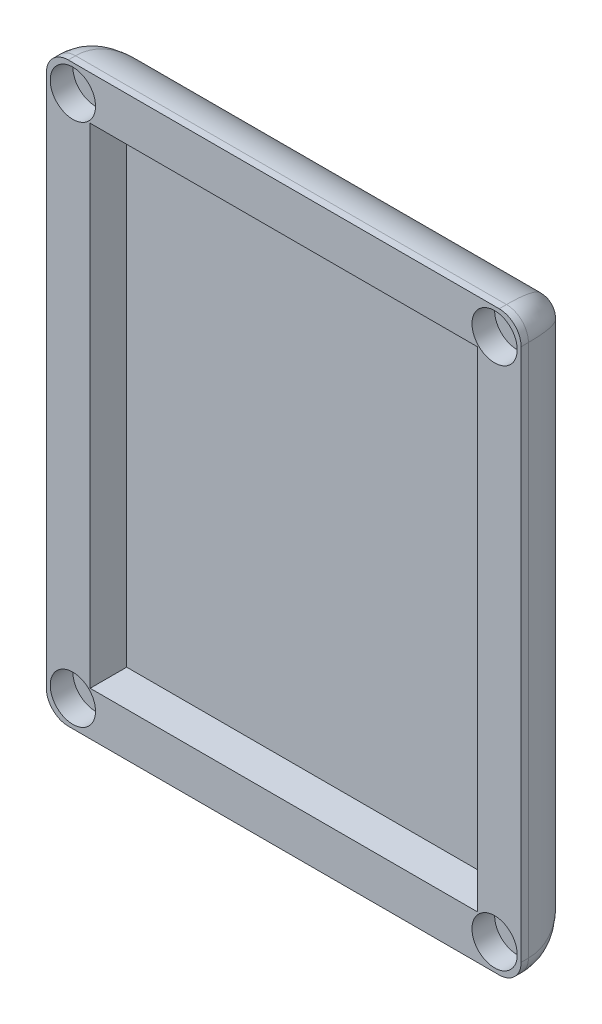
ISO-10303-21;
HEADER;
FILE_DESCRIPTION(('STEP AP214'),'2;1');
FILE_NAME('part.step','',(''),(''),'','','');
FILE_SCHEMA(('AUTOMOTIVE_DESIGN { 1 0 10303 214 1 1 1 1 }'));
ENDSEC;
DATA;
#1=APPLICATION_CONTEXT('core data for automotive mechanical design processes');
#2=APPLICATION_PROTOCOL_DEFINITION('international standard','automotive_design',2000,#1);
#3=PRODUCT_CONTEXT('',#1,'mechanical');
#4=PRODUCT('Part','Part','',(#3));
#5=PRODUCT_RELATED_PRODUCT_CATEGORY('part','',(#4));
#6=PRODUCT_DEFINITION_FORMATION('','',#4);
#7=PRODUCT_DEFINITION_CONTEXT('part definition',#1,'design');
#8=PRODUCT_DEFINITION('design','',#6,#7);
#9=PRODUCT_DEFINITION_SHAPE('','',#8);
#10=(LENGTH_UNIT() NAMED_UNIT(*) SI_UNIT(.MILLI.,.METRE.));
#11=(NAMED_UNIT(*) PLANE_ANGLE_UNIT() SI_UNIT($,.RADIAN.));
#12=(NAMED_UNIT(*) SI_UNIT($,.STERADIAN.) SOLID_ANGLE_UNIT());
#13=UNCERTAINTY_MEASURE_WITH_UNIT(LENGTH_MEASURE(1.E-05),#10,'distance_accuracy_value','');
#14=(GEOMETRIC_REPRESENTATION_CONTEXT(3) GLOBAL_UNCERTAINTY_ASSIGNED_CONTEXT((#13)) GLOBAL_UNIT_ASSIGNED_CONTEXT((#10,
#11,#12)) REPRESENTATION_CONTEXT('',''));
#15=CARTESIAN_POINT('',(0.,0.,0.));
#16=DIRECTION('',(0.,0.,1.));
#17=DIRECTION('',(1.,0.,0.));
#18=AXIS2_PLACEMENT_3D('',#15,#16,#17);
#19=CARTESIAN_POINT('',(0.,0.,10.));
#20=DIRECTION('',(0.,0.,-1.));
#21=DIRECTION('',(-1.,0.,0.));
#22=AXIS2_PLACEMENT_3D('',#19,#20,#21);
#23=PLANE('',#22);
#24=CARTESIAN_POINT('',(61.3705343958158,3.62946560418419,10.));
#25=DIRECTION('',(0.,0.,1.));
#26=DIRECTION('',(1.,0.,0.));
#27=AXIS2_PLACEMENT_3D('',#24,#25,#26);
#28=CIRCLE('',#27,3.1);
#29=CARTESIAN_POINT('',(64.4705343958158,3.62946560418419,10.));
#30=VERTEX_POINT('',#29);
#31=EDGE_CURVE('E316',#30,#30,#28,.T.);
#32=ORIENTED_EDGE('',*,*,#31,.F.);
#33=EDGE_LOOP('',(#32));
#34=FACE_BOUND('',#33,.T.);
#35=CARTESIAN_POINT('',(3.62946560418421,75.3705343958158,10.));
#36=DIRECTION('',(0.,0.,1.));
#37=DIRECTION('',(1.,0.,0.));
#38=AXIS2_PLACEMENT_3D('',#35,#36,#37);
#39=CIRCLE('',#38,3.1);
#40=CARTESIAN_POINT('',(6.72946560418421,75.3705343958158,10.));
#41=VERTEX_POINT('',#40);
#42=EDGE_CURVE('E304',#41,#41,#39,.T.);
#43=ORIENTED_EDGE('',*,*,#42,.F.);
#44=EDGE_LOOP('',(#43));
#45=FACE_BOUND('',#44,.T.);
#46=CARTESIAN_POINT('',(3.62946560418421,3.6294656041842,10.));
#47=DIRECTION('',(0.,0.,-1.));
#48=DIRECTION('',(-1.,0.,0.));
#49=AXIS2_PLACEMENT_3D('',#46,#47,#48);
#50=CIRCLE('',#49,3.1);
#51=CARTESIAN_POINT('',(6.72946560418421,3.6294656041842,10.));
#52=VERTEX_POINT('',#51);
#53=EDGE_CURVE('E170',#52,#52,#50,.T.);
#54=ORIENTED_EDGE('',*,*,#53,.T.);
#55=EDGE_LOOP('',(#54));
#56=FACE_BOUND('',#55,.T.);
#57=DIRECTION('',(-1.,0.,0.));
#58=VECTOR('',#57,1.);
#59=CARTESIAN_POINT('',(6.,73.,10.));
#60=LINE('',#59,#58);
#61=CARTESIAN_POINT('',(59.,73.,10.));
#62=VERTEX_POINT('',#61);
#63=CARTESIAN_POINT('',(6.,73.,10.));
#64=VERTEX_POINT('',#63);
#65=EDGE_CURVE('E176',#62,#64,#60,.T.);
#66=ORIENTED_EDGE('',*,*,#65,.F.);
#67=DIRECTION('',(0.,1.,0.));
#68=VECTOR('',#67,1.);
#69=CARTESIAN_POINT('',(59.,5.99999999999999,10.));
#70=LINE('',#69,#68);
#71=CARTESIAN_POINT('',(59.,5.99999999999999,10.));
#72=VERTEX_POINT('',#71);
#73=EDGE_CURVE('E147',#72,#62,#70,.T.);
#74=ORIENTED_EDGE('',*,*,#73,.F.);
#75=DIRECTION('',(1.,0.,0.));
#76=VECTOR('',#75,1.);
#77=CARTESIAN_POINT('',(6.00000000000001,5.99999999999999,10.));
#78=LINE('',#77,#76);
#79=CARTESIAN_POINT('',(6.00000000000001,5.99999999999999,10.));
#80=VERTEX_POINT('',#79);
#81=EDGE_CURVE('E164',#80,#72,#78,.T.);
#82=ORIENTED_EDGE('',*,*,#81,.F.);
#83=DIRECTION('',(0.,-1.,0.));
#84=VECTOR('',#83,1.);
#85=CARTESIAN_POINT('',(6.00000000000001,5.99999999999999,10.));
#86=LINE('',#85,#84);
#87=EDGE_CURVE('E167',#64,#80,#86,.T.);
#88=ORIENTED_EDGE('',*,*,#87,.F.);
#89=EDGE_LOOP('',(#66,#74,#82,#88));
#90=FACE_BOUND('',#89,.T.);
#91=DIRECTION('',(0.,-1.,0.));
#92=VECTOR('',#91,1.);
#93=CARTESIAN_POINT('',(0.,0.,10.));
#94=LINE('',#93,#92);
#95=CARTESIAN_POINT('',(0.,76.,10.));
#96=VERTEX_POINT('',#95);
#97=CARTESIAN_POINT('',(0.,3.,10.));
#98=VERTEX_POINT('',#97);
#99=EDGE_CURVE('E183',#96,#98,#94,.T.);
#100=ORIENTED_EDGE('',*,*,#99,.T.);
#101=CARTESIAN_POINT('',(3.,3.,10.));
#102=DIRECTION('',(0.,0.,-1.));
#103=DIRECTION('',(-1.,0.,0.));
#104=AXIS2_PLACEMENT_3D('',#101,#102,#103);
#105=CIRCLE('',#104,3.);
#106=CARTESIAN_POINT('',(3.,0.,10.));
#107=VERTEX_POINT('',#106);
#108=EDGE_CURVE('E213',#98,#107,#105,.F.);
#109=ORIENTED_EDGE('',*,*,#108,.T.);
#110=DIRECTION('',(1.,0.,0.));
#111=VECTOR('',#110,1.);
#112=CARTESIAN_POINT('',(0.,0.,10.));
#113=LINE('',#112,#111);
#114=CARTESIAN_POINT('',(62.,0.,10.));
#115=VERTEX_POINT('',#114);
#116=EDGE_CURVE('E189',#107,#115,#113,.T.);
#117=ORIENTED_EDGE('',*,*,#116,.T.);
#118=CARTESIAN_POINT('',(62.,3.,10.));
#119=DIRECTION('',(0.,0.,-1.));
#120=DIRECTION('',(-1.,0.,0.));
#121=AXIS2_PLACEMENT_3D('',#118,#119,#120);
#122=CIRCLE('',#121,3.);
#123=CARTESIAN_POINT('',(65.,3.,10.));
#124=VERTEX_POINT('',#123);
#125=EDGE_CURVE('E211',#115,#124,#122,.F.);
#126=ORIENTED_EDGE('',*,*,#125,.T.);
#127=DIRECTION('',(0.,1.,0.));
#128=VECTOR('',#127,1.);
#129=CARTESIAN_POINT('',(65.,0.,10.));
#130=LINE('',#129,#128);
#131=CARTESIAN_POINT('',(65.,76.,10.));
#132=VERTEX_POINT('',#131);
#133=EDGE_CURVE('E192',#124,#132,#130,.T.);
#134=ORIENTED_EDGE('',*,*,#133,.T.);
#135=CARTESIAN_POINT('',(62.,76.,10.));
#136=DIRECTION('',(0.,0.,-1.));
#137=DIRECTION('',(-1.,0.,0.));
#138=AXIS2_PLACEMENT_3D('',#135,#136,#137);
#139=CIRCLE('',#138,3.);
#140=CARTESIAN_POINT('',(62.,79.,10.));
#141=VERTEX_POINT('',#140);
#142=EDGE_CURVE('E209',#132,#141,#139,.F.);
#143=ORIENTED_EDGE('',*,*,#142,.T.);
#144=DIRECTION('',(-1.,0.,0.));
#145=VECTOR('',#144,1.);
#146=CARTESIAN_POINT('',(0.,79.,10.));
#147=LINE('',#146,#145);
#148=CARTESIAN_POINT('',(3.,79.,10.));
#149=VERTEX_POINT('',#148);
#150=EDGE_CURVE('E195',#141,#149,#147,.T.);
#151=ORIENTED_EDGE('',*,*,#150,.T.);
#152=CARTESIAN_POINT('',(3.,76.,10.));
#153=DIRECTION('',(0.,0.,-1.));
#154=DIRECTION('',(-1.,0.,0.));
#155=AXIS2_PLACEMENT_3D('',#152,#153,#154);
#156=CIRCLE('',#155,3.);
#157=EDGE_CURVE('E207',#149,#96,#156,.F.);
#158=ORIENTED_EDGE('',*,*,#157,.T.);
#159=EDGE_LOOP('',(#100,#109,#117,#126,#134,#143,#151,#158));
#160=FACE_BOUND('',#159,.T.);
#161=CARTESIAN_POINT('',(61.3705343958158,75.3705343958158,10.));
#162=DIRECTION('',(0.,0.,-1.));
#163=DIRECTION('',(-1.,0.,0.));
#164=AXIS2_PLACEMENT_3D('',#161,#162,#163);
#165=CIRCLE('',#164,3.1);
#166=CARTESIAN_POINT('',(64.4705343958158,75.3705343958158,10.));
#167=VERTEX_POINT('',#166);
#168=EDGE_CURVE('E325',#167,#167,#165,.T.);
#169=ORIENTED_EDGE('',*,*,#168,.T.);
#170=EDGE_LOOP('',(#169));
#171=FACE_BOUND('',#170,.T.);
#172=ADVANCED_FACE('F35',(#34,#45,#56,#90,#160,#171),#23,.F.);
#173=CARTESIAN_POINT('',(0.,0.,10.));
#174=DIRECTION('',(1.,0.,0.));
#175=DIRECTION('',(0.,0.,-1.));
#176=AXIS2_PLACEMENT_3D('',#173,#174,#175);
#177=PLANE('',#176);
#178=DIRECTION('',(0.,0.,-1.));
#179=VECTOR('',#178,1.);
#180=CARTESIAN_POINT('',(0.,76.,10.));
#181=LINE('',#180,#179);
#182=CARTESIAN_POINT('',(0.,76.,9.));
#183=VERTEX_POINT('',#182);
#184=EDGE_CURVE('E202',#96,#183,#181,.T.);
#185=ORIENTED_EDGE('',*,*,#184,.T.);
#186=DIRECTION('',(0.,-1.,0.));
#187=VECTOR('',#186,1.);
#188=CARTESIAN_POINT('',(0.,3.,9.));
#189=LINE('',#188,#187);
#190=CARTESIAN_POINT('',(0.,3.,9.));
#191=VERTEX_POINT('',#190);
#192=EDGE_CURVE('E227',#183,#191,#189,.T.);
#193=ORIENTED_EDGE('',*,*,#192,.T.);
#194=DIRECTION('',(0.,0.,-1.));
#195=VECTOR('',#194,1.);
#196=CARTESIAN_POINT('',(0.,3.,10.));
#197=LINE('',#196,#195);
#198=EDGE_CURVE('E205',#191,#98,#197,.F.);
#199=ORIENTED_EDGE('',*,*,#198,.T.);
#200=ORIENTED_EDGE('',*,*,#99,.F.);
#201=EDGE_LOOP('',(#185,#193,#199,#200));
#202=FACE_BOUND('',#201,.T.);
#203=ADVANCED_FACE('F350',(#202),#177,.F.);
#204=CARTESIAN_POINT('',(0.,0.,10.));
#205=DIRECTION('',(0.,1.,0.));
#206=DIRECTION('',(0.,0.,1.));
#207=AXIS2_PLACEMENT_3D('',#204,#205,#206);
#208=PLANE('',#207);
#209=DIRECTION('',(0.,0.,-1.));
#210=VECTOR('',#209,1.);
#211=CARTESIAN_POINT('',(3.,0.,10.));
#212=LINE('',#211,#210);
#213=CARTESIAN_POINT('',(3.,0.,9.));
#214=VERTEX_POINT('',#213);
#215=EDGE_CURVE('E200',#107,#214,#212,.T.);
#216=ORIENTED_EDGE('',*,*,#215,.T.);
#217=DIRECTION('',(1.,0.,0.));
#218=VECTOR('',#217,1.);
#219=CARTESIAN_POINT('',(62.,0.,9.));
#220=LINE('',#219,#218);
#221=CARTESIAN_POINT('',(62.,0.,9.));
#222=VERTEX_POINT('',#221);
#223=EDGE_CURVE('E11',#214,#222,#220,.T.);
#224=ORIENTED_EDGE('',*,*,#223,.T.);
#225=DIRECTION('',(0.,0.,-1.));
#226=VECTOR('',#225,1.);
#227=CARTESIAN_POINT('',(62.,0.,10.));
#228=LINE('',#227,#226);
#229=EDGE_CURVE('E198',#222,#115,#228,.F.);
#230=ORIENTED_EDGE('',*,*,#229,.T.);
#231=ORIENTED_EDGE('',*,*,#116,.F.);
#232=EDGE_LOOP('',(#216,#224,#230,#231));
#233=FACE_BOUND('',#232,.T.);
#234=ADVANCED_FACE('F356',(#233),#208,.F.);
#235=CARTESIAN_POINT('',(65.,0.,10.));
#236=DIRECTION('',(-1.,0.,0.));
#237=DIRECTION('',(0.,-1.,0.));
#238=AXIS2_PLACEMENT_3D('',#235,#236,#237);
#239=PLANE('',#238);
#240=DIRECTION('',(0.,0.,-1.));
#241=VECTOR('',#240,1.);
#242=CARTESIAN_POINT('',(65.,3.,10.));
#243=LINE('',#242,#241);
#244=CARTESIAN_POINT('',(65.,3.,9.));
#245=VERTEX_POINT('',#244);
#246=EDGE_CURVE('E217',#124,#245,#243,.T.);
#247=ORIENTED_EDGE('',*,*,#246,.T.);
#248=DIRECTION('',(0.,1.,0.));
#249=VECTOR('',#248,1.);
#250=CARTESIAN_POINT('',(65.,76.,9.));
#251=LINE('',#250,#249);
#252=CARTESIAN_POINT('',(65.,76.,9.));
#253=VERTEX_POINT('',#252);
#254=EDGE_CURVE('E244',#245,#253,#251,.T.);
#255=ORIENTED_EDGE('',*,*,#254,.T.);
#256=DIRECTION('',(0.,0.,-1.));
#257=VECTOR('',#256,1.);
#258=CARTESIAN_POINT('',(65.,76.,10.));
#259=LINE('',#258,#257);
#260=EDGE_CURVE('E215',#253,#132,#259,.F.);
#261=ORIENTED_EDGE('',*,*,#260,.T.);
#262=ORIENTED_EDGE('',*,*,#133,.F.);
#263=EDGE_LOOP('',(#247,#255,#261,#262));
#264=FACE_BOUND('',#263,.T.);
#265=ADVANCED_FACE('F370',(#264),#239,.F.);
#266=CARTESIAN_POINT('',(0.,79.,10.));
#267=DIRECTION('',(0.,-1.,0.));
#268=DIRECTION('',(0.,0.,-1.));
#269=AXIS2_PLACEMENT_3D('',#266,#267,#268);
#270=PLANE('',#269);
#271=DIRECTION('',(0.,0.,-1.));
#272=VECTOR('',#271,1.);
#273=CARTESIAN_POINT('',(62.,79.,10.));
#274=LINE('',#273,#272);
#275=CARTESIAN_POINT('',(62.,79.,9.));
#276=VERTEX_POINT('',#275);
#277=EDGE_CURVE('E221',#141,#276,#274,.T.);
#278=ORIENTED_EDGE('',*,*,#277,.T.);
#279=DIRECTION('',(-1.,0.,0.));
#280=VECTOR('',#279,1.);
#281=CARTESIAN_POINT('',(3.,79.,9.));
#282=LINE('',#281,#280);
#283=CARTESIAN_POINT('',(3.,79.,9.));
#284=VERTEX_POINT('',#283);
#285=EDGE_CURVE('E240',#276,#284,#282,.T.);
#286=ORIENTED_EDGE('',*,*,#285,.T.);
#287=DIRECTION('',(0.,0.,-1.));
#288=VECTOR('',#287,1.);
#289=CARTESIAN_POINT('',(3.,79.,10.));
#290=LINE('',#289,#288);
#291=EDGE_CURVE('E219',#284,#149,#290,.F.);
#292=ORIENTED_EDGE('',*,*,#291,.T.);
#293=ORIENTED_EDGE('',*,*,#150,.F.);
#294=EDGE_LOOP('',(#278,#286,#292,#293));
#295=FACE_BOUND('',#294,.T.);
#296=ADVANCED_FACE('F366',(#295),#270,.F.);
#297=CARTESIAN_POINT('',(0.,0.,0.));
#298=DIRECTION('',(0.,0.,-1.));
#299=DIRECTION('',(-1.,0.,0.));
#300=AXIS2_PLACEMENT_3D('',#297,#298,#299);
#301=PLANE('',#300);
#302=DIRECTION('',(1.,0.,0.));
#303=VECTOR('',#302,1.);
#304=CARTESIAN_POINT('',(3.,9.,0.));
#305=LINE('',#304,#303);
#306=CARTESIAN_POINT('',(56.,9.,0.));
#307=VERTEX_POINT('',#306);
#308=CARTESIAN_POINT('',(9.,9.,0.));
#309=VERTEX_POINT('',#308);
#310=EDGE_CURVE('E229',#307,#309,#305,.F.);
#311=ORIENTED_EDGE('',*,*,#310,.T.);
#312=DIRECTION('',(0.,-1.,0.));
#313=VECTOR('',#312,1.);
#314=CARTESIAN_POINT('',(9.,76.,0.));
#315=LINE('',#314,#313);
#316=CARTESIAN_POINT('',(9.,70.,0.));
#317=VERTEX_POINT('',#316);
#318=EDGE_CURVE('E235',#309,#317,#315,.F.);
#319=ORIENTED_EDGE('',*,*,#318,.T.);
#320=DIRECTION('',(-1.,0.,0.));
#321=VECTOR('',#320,1.);
#322=CARTESIAN_POINT('',(62.,70.,0.));
#323=LINE('',#322,#321);
#324=CARTESIAN_POINT('',(56.,70.,0.));
#325=VERTEX_POINT('',#324);
#326=EDGE_CURVE('E233',#317,#325,#323,.F.);
#327=ORIENTED_EDGE('',*,*,#326,.T.);
#328=DIRECTION('',(0.,1.,0.));
#329=VECTOR('',#328,1.);
#330=CARTESIAN_POINT('',(56.,3.,0.));
#331=LINE('',#330,#329);
#332=EDGE_CURVE('E231',#325,#307,#331,.F.);
#333=ORIENTED_EDGE('',*,*,#332,.T.);
#334=EDGE_LOOP('',(#311,#319,#327,#333));
#335=FACE_BOUND('',#334,.T.);
#336=ADVANCED_FACE('F363',(#335),#301,.T.);
#337=CARTESIAN_POINT('',(59.,5.99999999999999,5.));
#338=DIRECTION('',(1.,0.,0.));
#339=DIRECTION('',(0.,1.,0.));
#340=AXIS2_PLACEMENT_3D('',#337,#338,#339);
#341=PLANE('',#340);
#342=ORIENTED_EDGE('',*,*,#73,.T.);
#343=DIRECTION('',(0.,0.,1.));
#344=VECTOR('',#343,1.);
#345=CARTESIAN_POINT('',(59.,73.,5.));
#346=LINE('',#345,#344);
#347=CARTESIAN_POINT('',(59.,73.,5.));
#348=VERTEX_POINT('',#347);
#349=EDGE_CURVE('E140',#348,#62,#346,.T.);
#350=ORIENTED_EDGE('',*,*,#349,.F.);
#351=DIRECTION('',(0.,1.,0.));
#352=VECTOR('',#351,1.);
#353=CARTESIAN_POINT('',(59.,5.99999999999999,5.));
#354=LINE('',#353,#352);
#355=CARTESIAN_POINT('',(59.,5.99999999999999,5.));
#356=VERTEX_POINT('',#355);
#357=EDGE_CURVE('E144',#356,#348,#354,.T.);
#358=ORIENTED_EDGE('',*,*,#357,.F.);
#359=DIRECTION('',(0.,0.,1.));
#360=VECTOR('',#359,1.);
#361=CARTESIAN_POINT('',(59.,5.99999999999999,5.));
#362=LINE('',#361,#360);
#363=EDGE_CURVE('E181',#356,#72,#362,.T.);
#364=ORIENTED_EDGE('',*,*,#363,.T.);
#365=EDGE_LOOP('',(#342,#350,#358,#364));
#366=FACE_BOUND('',#365,.T.);
#367=ADVANCED_FACE('F142',(#366),#341,.F.);
#368=CARTESIAN_POINT('',(6.00000000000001,5.99999999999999,5.));
#369=DIRECTION('',(0.,-1.,0.));
#370=DIRECTION('',(1.,0.,0.));
#371=AXIS2_PLACEMENT_3D('',#368,#369,#370);
#372=PLANE('',#371);
#373=ORIENTED_EDGE('',*,*,#81,.T.);
#374=ORIENTED_EDGE('',*,*,#363,.F.);
#375=DIRECTION('',(1.,0.,0.));
#376=VECTOR('',#375,1.);
#377=CARTESIAN_POINT('',(6.00000000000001,5.99999999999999,5.));
#378=LINE('',#377,#376);
#379=CARTESIAN_POINT('',(6.00000000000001,5.99999999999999,5.));
#380=VERTEX_POINT('',#379);
#381=EDGE_CURVE('E152',#380,#356,#378,.T.);
#382=ORIENTED_EDGE('',*,*,#381,.F.);
#383=DIRECTION('',(0.,0.,1.));
#384=VECTOR('',#383,1.);
#385=CARTESIAN_POINT('',(6.00000000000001,5.99999999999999,5.));
#386=LINE('',#385,#384);
#387=EDGE_CURVE('E184',#380,#80,#386,.T.);
#388=ORIENTED_EDGE('',*,*,#387,.T.);
#389=EDGE_LOOP('',(#373,#374,#382,#388));
#390=FACE_BOUND('',#389,.T.);
#391=ADVANCED_FACE('F581',(#390),#372,.F.);
#392=CARTESIAN_POINT('',(6.00000000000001,5.99999999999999,5.));
#393=DIRECTION('',(-1.,0.,0.));
#394=DIRECTION('',(0.,-1.,0.));
#395=AXIS2_PLACEMENT_3D('',#392,#393,#394);
#396=PLANE('',#395);
#397=ORIENTED_EDGE('',*,*,#87,.T.);
#398=ORIENTED_EDGE('',*,*,#387,.F.);
#399=DIRECTION('',(0.,-1.,0.));
#400=VECTOR('',#399,1.);
#401=CARTESIAN_POINT('',(6.00000000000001,5.99999999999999,5.));
#402=LINE('',#401,#400);
#403=CARTESIAN_POINT('',(6.,73.,5.));
#404=VERTEX_POINT('',#403);
#405=EDGE_CURVE('E160',#404,#380,#402,.T.);
#406=ORIENTED_EDGE('',*,*,#405,.F.);
#407=DIRECTION('',(0.,0.,1.));
#408=VECTOR('',#407,1.);
#409=CARTESIAN_POINT('',(6.,73.,5.));
#410=LINE('',#409,#408);
#411=EDGE_CURVE('E151',#404,#64,#410,.T.);
#412=ORIENTED_EDGE('',*,*,#411,.T.);
#413=EDGE_LOOP('',(#397,#398,#406,#412));
#414=FACE_BOUND('',#413,.T.);
#415=ADVANCED_FACE('F573',(#414),#396,.F.);
#416=CARTESIAN_POINT('',(6.,73.,5.));
#417=DIRECTION('',(0.,1.,0.));
#418=DIRECTION('',(0.,0.,1.));
#419=AXIS2_PLACEMENT_3D('',#416,#417,#418);
#420=PLANE('',#419);
#421=ORIENTED_EDGE('',*,*,#65,.T.);
#422=ORIENTED_EDGE('',*,*,#411,.F.);
#423=DIRECTION('',(-1.,0.,0.));
#424=VECTOR('',#423,1.);
#425=CARTESIAN_POINT('',(6.,73.,5.));
#426=LINE('',#425,#424);
#427=EDGE_CURVE('E155',#348,#404,#426,.T.);
#428=ORIENTED_EDGE('',*,*,#427,.F.);
#429=ORIENTED_EDGE('',*,*,#349,.T.);
#430=EDGE_LOOP('',(#421,#422,#428,#429));
#431=FACE_BOUND('',#430,.T.);
#432=ADVANCED_FACE('F156',(#431),#420,.F.);
#433=CARTESIAN_POINT('',(0.,0.,5.));
#434=DIRECTION('',(0.,0.,-1.));
#435=DIRECTION('',(-1.,0.,0.));
#436=AXIS2_PLACEMENT_3D('',#433,#434,#435);
#437=PLANE('',#436);
#438=ORIENTED_EDGE('',*,*,#357,.T.);
#439=ORIENTED_EDGE('',*,*,#427,.T.);
#440=ORIENTED_EDGE('',*,*,#405,.T.);
#441=ORIENTED_EDGE('',*,*,#381,.T.);
#442=EDGE_LOOP('',(#438,#439,#440,#441));
#443=FACE_BOUND('',#442,.T.);
#444=ADVANCED_FACE('F162',(#443),#437,.F.);
#445=CARTESIAN_POINT('',(3.62946560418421,3.6294656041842,6.9));
#446=DIRECTION('',(0.,0.,1.));
#447=DIRECTION('',(1.,0.,0.));
#448=AXIS2_PLACEMENT_3D('',#445,#446,#447);
#449=CYLINDRICAL_SURFACE('',#448,3.1);
#450=CARTESIAN_POINT('',(3.62946560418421,3.6294656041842,6.9));
#451=DIRECTION('',(0.,0.,-1.));
#452=DIRECTION('',(-1.,0.,0.));
#453=AXIS2_PLACEMENT_3D('',#450,#451,#452);
#454=CIRCLE('',#453,3.1);
#455=CARTESIAN_POINT('',(6.72946560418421,3.6294656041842,6.9));
#456=VERTEX_POINT('',#455);
#457=EDGE_CURVE('E177',#456,#456,#454,.T.);
#458=CARTESIAN_POINT('',(6.72946560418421,3.6294656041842,6.9));
#459=CARTESIAN_POINT('',(6.72946560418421,3.6294656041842,6.93229166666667));
#460=CARTESIAN_POINT('',(6.72946560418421,3.6294656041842,6.96458333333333));
#461=CARTESIAN_POINT('',(6.72946560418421,3.6294656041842,7.02916666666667));
#462=CARTESIAN_POINT('',(6.72946560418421,3.6294656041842,7.06145833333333));
#463=CARTESIAN_POINT('',(6.72946560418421,3.6294656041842,7.12604166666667));
#464=CARTESIAN_POINT('',(6.72946560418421,3.6294656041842,7.15833333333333));
#465=CARTESIAN_POINT('',(6.72946560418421,3.6294656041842,7.22291666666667));
#466=CARTESIAN_POINT('',(6.72946560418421,3.6294656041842,7.25520833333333));
#467=CARTESIAN_POINT('',(6.72946560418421,3.6294656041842,7.31979166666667));
#468=CARTESIAN_POINT('',(6.72946560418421,3.6294656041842,7.35208333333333));
#469=CARTESIAN_POINT('',(6.72946560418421,3.6294656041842,7.41666666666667));
#470=CARTESIAN_POINT('',(6.72946560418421,3.6294656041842,7.44895833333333));
#471=CARTESIAN_POINT('',(6.72946560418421,3.6294656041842,7.51354166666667));
#472=CARTESIAN_POINT('',(6.72946560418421,3.6294656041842,7.54583333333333));
#473=CARTESIAN_POINT('',(6.72946560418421,3.6294656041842,7.61041666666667));
#474=CARTESIAN_POINT('',(6.72946560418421,3.6294656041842,7.64270833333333));
#475=CARTESIAN_POINT('',(6.72946560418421,3.6294656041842,7.70729166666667));
#476=CARTESIAN_POINT('',(6.72946560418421,3.6294656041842,7.73958333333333));
#477=CARTESIAN_POINT('',(6.72946560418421,3.6294656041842,7.80416666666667));
#478=CARTESIAN_POINT('',(6.72946560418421,3.6294656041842,7.83645833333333));
#479=CARTESIAN_POINT('',(6.72946560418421,3.6294656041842,7.90104166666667));
#480=CARTESIAN_POINT('',(6.72946560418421,3.6294656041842,7.93333333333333));
#481=CARTESIAN_POINT('',(6.72946560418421,3.6294656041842,7.99791666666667));
#482=CARTESIAN_POINT('',(6.72946560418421,3.6294656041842,8.03020833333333));
#483=CARTESIAN_POINT('',(6.72946560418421,3.6294656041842,8.09479166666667));
#484=CARTESIAN_POINT('',(6.72946560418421,3.6294656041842,8.12708333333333));
#485=CARTESIAN_POINT('',(6.72946560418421,3.6294656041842,8.19166666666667));
#486=CARTESIAN_POINT('',(6.72946560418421,3.6294656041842,8.22395833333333));
#487=CARTESIAN_POINT('',(6.72946560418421,3.6294656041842,8.28854166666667));
#488=CARTESIAN_POINT('',(6.72946560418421,3.6294656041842,8.32083333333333));
#489=CARTESIAN_POINT('',(6.72946560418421,3.6294656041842,8.38541666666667));
#490=CARTESIAN_POINT('',(6.72946560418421,3.6294656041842,8.41770833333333));
#491=CARTESIAN_POINT('',(6.72946560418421,3.6294656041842,8.48229166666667));
#492=CARTESIAN_POINT('',(6.72946560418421,3.6294656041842,8.51458333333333));
#493=CARTESIAN_POINT('',(6.72946560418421,3.6294656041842,8.57916666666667));
#494=CARTESIAN_POINT('',(6.72946560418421,3.6294656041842,8.61145833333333));
#495=CARTESIAN_POINT('',(6.72946560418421,3.6294656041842,8.67604166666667));
#496=CARTESIAN_POINT('',(6.72946560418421,3.6294656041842,8.70833333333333));
#497=CARTESIAN_POINT('',(6.72946560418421,3.6294656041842,8.77291666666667));
#498=CARTESIAN_POINT('',(6.72946560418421,3.6294656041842,8.80520833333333));
#499=CARTESIAN_POINT('',(6.72946560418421,3.6294656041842,8.86979166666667));
#500=CARTESIAN_POINT('',(6.72946560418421,3.6294656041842,8.90208333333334));
#501=CARTESIAN_POINT('',(6.72946560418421,3.6294656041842,8.96666666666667));
#502=CARTESIAN_POINT('',(6.72946560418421,3.6294656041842,8.99895833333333));
#503=CARTESIAN_POINT('',(6.72946560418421,3.6294656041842,9.06354166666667));
#504=CARTESIAN_POINT('',(6.72946560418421,3.6294656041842,9.09583333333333));
#505=CARTESIAN_POINT('',(6.72946560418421,3.6294656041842,9.16041666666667));
#506=CARTESIAN_POINT('',(6.72946560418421,3.6294656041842,9.19270833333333));
#507=CARTESIAN_POINT('',(6.72946560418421,3.6294656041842,9.25729166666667));
#508=CARTESIAN_POINT('',(6.72946560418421,3.6294656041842,9.28958333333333));
#509=CARTESIAN_POINT('',(6.72946560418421,3.6294656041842,9.35416666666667));
#510=CARTESIAN_POINT('',(6.72946560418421,3.6294656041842,9.38645833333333));
#511=CARTESIAN_POINT('',(6.72946560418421,3.6294656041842,9.45104166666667));
#512=CARTESIAN_POINT('',(6.72946560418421,3.6294656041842,9.48333333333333));
#513=CARTESIAN_POINT('',(6.72946560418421,3.6294656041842,9.54791666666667));
#514=CARTESIAN_POINT('',(6.72946560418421,3.6294656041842,9.58020833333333));
#515=CARTESIAN_POINT('',(6.72946560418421,3.6294656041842,9.64479166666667));
#516=CARTESIAN_POINT('',(6.72946560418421,3.6294656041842,9.67708333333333));
#517=CARTESIAN_POINT('',(6.72946560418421,3.6294656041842,9.74166666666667));
#518=CARTESIAN_POINT('',(6.72946560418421,3.6294656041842,9.77395833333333));
#519=CARTESIAN_POINT('',(6.72946560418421,3.6294656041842,9.83854166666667));
#520=CARTESIAN_POINT('',(6.72946560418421,3.6294656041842,9.87083333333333));
#521=CARTESIAN_POINT('',(6.72946560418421,3.6294656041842,9.93541666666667));
#522=CARTESIAN_POINT('',(6.72946560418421,3.6294656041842,9.96770833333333));
#523=CARTESIAN_POINT('',(6.72946560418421,3.6294656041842,10.));
#524=B_SPLINE_CURVE_WITH_KNOTS('',3,(#458,#459,#460,#461,#462,#463,#464,#465,#466,#467,#468,
#469,#470,#471,#472,#473,#474,#475,#476,#477,#478,#479,#480,#481,#482,#483,#484,#485,#486,#487,
#488,#489,#490,#491,#492,#493,#494,#495,#496,#497,#498,#499,#500,#501,#502,#503,#504,#505,#506,
#507,#508,#509,#510,#511,#512,#513,#514,#515,#516,#517,#518,#519,#520,#521,#522,#523),
.UNSPECIFIED.,.F.,.F.,(4,2,2,2,2,2,2,2,2,2,2,2,2,2,2,2,2,2,2,2,2,2,2,2,2,2,2,2,2,2,2,2,4),(0.,
0.0968750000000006,0.19375,0.290625,0.387500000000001,0.484375,0.58125,0.678125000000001,0.775,
0.871875,0.968750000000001,1.065625,1.1625,1.259375,1.35625,1.453125,1.55,1.646875,1.74375,
1.840625,1.9375,2.034375,2.13125,2.228125,2.325,2.421875,2.51875,2.615625,2.7125,2.809375,
2.90625,3.003125,3.1),.UNSPECIFIED.);
#525=EDGE_CURVE('BSEAM549',#456,#52,#524,.T.);
#526=ORIENTED_EDGE('',*,*,#457,.T.);
#527=ORIENTED_EDGE('',*,*,#53,.F.);
#528=ORIENTED_EDGE('',*,*,#525,.T.);
#529=ORIENTED_EDGE('',*,*,#525,.F.);
#530=EDGE_LOOP('',(#526,#528,#527,#529));
#531=FACE_BOUND('',#530,.T.);
#532=ADVANCED_FACE('F549',(#531),#449,.F.);
#533=CARTESIAN_POINT('',(3.62946560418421,3.6294656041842,6.9));
#534=DIRECTION('',(0.,0.,-1.));
#535=DIRECTION('',(-1.,0.,0.));
#536=AXIS2_PLACEMENT_3D('',#533,#534,#535);
#537=PLANE('',#536);
#538=ORIENTED_EDGE('',*,*,#457,.F.);
#539=EDGE_LOOP('',(#538));
#540=FACE_BOUND('',#539,.T.);
#541=ADVANCED_FACE('F540',(#540),#537,.F.);
#542=CARTESIAN_POINT('',(3.62946560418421,75.3705343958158,6.9));
#543=DIRECTION('',(0.,0.,1.));
#544=DIRECTION('',(1.,0.,0.));
#545=AXIS2_PLACEMENT_3D('',#542,#543,#544);
#546=CYLINDRICAL_SURFACE('',#545,3.1);
#547=CARTESIAN_POINT('',(3.62946560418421,75.3705343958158,6.9));
#548=DIRECTION('',(0.,0.,1.));
#549=DIRECTION('',(1.,0.,0.));
#550=AXIS2_PLACEMENT_3D('',#547,#548,#549);
#551=CIRCLE('',#550,3.1);
#552=CARTESIAN_POINT('',(6.72946560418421,75.3705343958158,6.9));
#553=VERTEX_POINT('',#552);
#554=EDGE_CURVE('E298',#553,#553,#551,.T.);
#555=CARTESIAN_POINT('',(6.72946560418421,75.3705343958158,6.9));
#556=CARTESIAN_POINT('',(6.72946560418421,75.3705343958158,6.93229166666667));
#557=CARTESIAN_POINT('',(6.72946560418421,75.3705343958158,6.96458333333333));
#558=CARTESIAN_POINT('',(6.72946560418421,75.3705343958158,7.02916666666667));
#559=CARTESIAN_POINT('',(6.72946560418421,75.3705343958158,7.06145833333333));
#560=CARTESIAN_POINT('',(6.72946560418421,75.3705343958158,7.12604166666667));
#561=CARTESIAN_POINT('',(6.72946560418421,75.3705343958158,7.15833333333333));
#562=CARTESIAN_POINT('',(6.72946560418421,75.3705343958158,7.22291666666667));
#563=CARTESIAN_POINT('',(6.72946560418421,75.3705343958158,7.25520833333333));
#564=CARTESIAN_POINT('',(6.72946560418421,75.3705343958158,7.31979166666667));
#565=CARTESIAN_POINT('',(6.72946560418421,75.3705343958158,7.35208333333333));
#566=CARTESIAN_POINT('',(6.72946560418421,75.3705343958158,7.41666666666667));
#567=CARTESIAN_POINT('',(6.72946560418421,75.3705343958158,7.44895833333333));
#568=CARTESIAN_POINT('',(6.72946560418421,75.3705343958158,7.51354166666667));
#569=CARTESIAN_POINT('',(6.72946560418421,75.3705343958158,7.54583333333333));
#570=CARTESIAN_POINT('',(6.72946560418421,75.3705343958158,7.61041666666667));
#571=CARTESIAN_POINT('',(6.72946560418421,75.3705343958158,7.64270833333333));
#572=CARTESIAN_POINT('',(6.72946560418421,75.3705343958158,7.70729166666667));
#573=CARTESIAN_POINT('',(6.72946560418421,75.3705343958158,7.73958333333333));
#574=CARTESIAN_POINT('',(6.72946560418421,75.3705343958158,7.80416666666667));
#575=CARTESIAN_POINT('',(6.72946560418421,75.3705343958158,7.83645833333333));
#576=CARTESIAN_POINT('',(6.72946560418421,75.3705343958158,7.90104166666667));
#577=CARTESIAN_POINT('',(6.72946560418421,75.3705343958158,7.93333333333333));
#578=CARTESIAN_POINT('',(6.72946560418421,75.3705343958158,7.99791666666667));
#579=CARTESIAN_POINT('',(6.72946560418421,75.3705343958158,8.03020833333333));
#580=CARTESIAN_POINT('',(6.72946560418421,75.3705343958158,8.09479166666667));
#581=CARTESIAN_POINT('',(6.72946560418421,75.3705343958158,8.12708333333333));
#582=CARTESIAN_POINT('',(6.72946560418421,75.3705343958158,8.19166666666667));
#583=CARTESIAN_POINT('',(6.72946560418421,75.3705343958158,8.22395833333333));
#584=CARTESIAN_POINT('',(6.72946560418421,75.3705343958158,8.28854166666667));
#585=CARTESIAN_POINT('',(6.72946560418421,75.3705343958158,8.32083333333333));
#586=CARTESIAN_POINT('',(6.72946560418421,75.3705343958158,8.38541666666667));
#587=CARTESIAN_POINT('',(6.72946560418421,75.3705343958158,8.41770833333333));
#588=CARTESIAN_POINT('',(6.72946560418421,75.3705343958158,8.48229166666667));
#589=CARTESIAN_POINT('',(6.72946560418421,75.3705343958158,8.51458333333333));
#590=CARTESIAN_POINT('',(6.72946560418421,75.3705343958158,8.57916666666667));
#591=CARTESIAN_POINT('',(6.72946560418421,75.3705343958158,8.61145833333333));
#592=CARTESIAN_POINT('',(6.72946560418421,75.3705343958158,8.67604166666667));
#593=CARTESIAN_POINT('',(6.72946560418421,75.3705343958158,8.70833333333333));
#594=CARTESIAN_POINT('',(6.72946560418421,75.3705343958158,8.77291666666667));
#595=CARTESIAN_POINT('',(6.72946560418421,75.3705343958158,8.80520833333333));
#596=CARTESIAN_POINT('',(6.72946560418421,75.3705343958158,8.86979166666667));
#597=CARTESIAN_POINT('',(6.72946560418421,75.3705343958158,8.90208333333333));
#598=CARTESIAN_POINT('',(6.72946560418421,75.3705343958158,8.96666666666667));
#599=CARTESIAN_POINT('',(6.72946560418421,75.3705343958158,8.99895833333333));
#600=CARTESIAN_POINT('',(6.72946560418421,75.3705343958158,9.06354166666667));
#601=CARTESIAN_POINT('',(6.72946560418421,75.3705343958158,9.09583333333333));
#602=CARTESIAN_POINT('',(6.72946560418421,75.3705343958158,9.16041666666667));
#603=CARTESIAN_POINT('',(6.72946560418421,75.3705343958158,9.19270833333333));
#604=CARTESIAN_POINT('',(6.72946560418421,75.3705343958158,9.25729166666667));
#605=CARTESIAN_POINT('',(6.72946560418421,75.3705343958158,9.28958333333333));
#606=CARTESIAN_POINT('',(6.72946560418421,75.3705343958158,9.35416666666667));
#607=CARTESIAN_POINT('',(6.72946560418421,75.3705343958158,9.38645833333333));
#608=CARTESIAN_POINT('',(6.72946560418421,75.3705343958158,9.45104166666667));
#609=CARTESIAN_POINT('',(6.72946560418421,75.3705343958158,9.48333333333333));
#610=CARTESIAN_POINT('',(6.72946560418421,75.3705343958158,9.54791666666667));
#611=CARTESIAN_POINT('',(6.72946560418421,75.3705343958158,9.58020833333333));
#612=CARTESIAN_POINT('',(6.72946560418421,75.3705343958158,9.64479166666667));
#613=CARTESIAN_POINT('',(6.72946560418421,75.3705343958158,9.67708333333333));
#614=CARTESIAN_POINT('',(6.72946560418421,75.3705343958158,9.74166666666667));
#615=CARTESIAN_POINT('',(6.72946560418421,75.3705343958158,9.77395833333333));
#616=CARTESIAN_POINT('',(6.72946560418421,75.3705343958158,9.83854166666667));
#617=CARTESIAN_POINT('',(6.72946560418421,75.3705343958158,9.87083333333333));
#618=CARTESIAN_POINT('',(6.72946560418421,75.3705343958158,9.93541666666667));
#619=CARTESIAN_POINT('',(6.72946560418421,75.3705343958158,9.96770833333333));
#620=CARTESIAN_POINT('',(6.72946560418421,75.3705343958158,10.));
#621=B_SPLINE_CURVE_WITH_KNOTS('',3,(#555,#556,#557,#558,#559,#560,#561,#562,#563,#564,#565,
#566,#567,#568,#569,#570,#571,#572,#573,#574,#575,#576,#577,#578,#579,#580,#581,#582,#583,#584,
#585,#586,#587,#588,#589,#590,#591,#592,#593,#594,#595,#596,#597,#598,#599,#600,#601,#602,#603,
#604,#605,#606,#607,#608,#609,#610,#611,#612,#613,#614,#615,#616,#617,#618,#619,#620),
.UNSPECIFIED.,.F.,.F.,(4,2,2,2,2,2,2,2,2,2,2,2,2,2,2,2,2,2,2,2,2,2,2,2,2,2,2,2,2,2,2,2,4),(0.,
0.0968750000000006,0.19375,0.290625,0.387500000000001,0.484375,0.58125,0.678125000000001,0.775,
0.871875,0.96875,1.065625,1.1625,1.259375,1.35625,1.453125,1.55,1.646875,1.74375,1.840625,
1.9375,2.034375,2.13125,2.228125,2.325,2.421875,2.51875,2.615625,2.7125,2.809375,2.90625,
3.003125,3.1),.UNSPECIFIED.);
#622=EDGE_CURVE('BSEAM531',#553,#41,#621,.T.);
#623=ORIENTED_EDGE('',*,*,#554,.F.);
#624=ORIENTED_EDGE('',*,*,#42,.T.);
#625=ORIENTED_EDGE('',*,*,#622,.T.);
#626=ORIENTED_EDGE('',*,*,#622,.F.);
#627=EDGE_LOOP('',(#623,#625,#624,#626));
#628=FACE_BOUND('',#627,.T.);
#629=ADVANCED_FACE('F531',(#628),#546,.F.);
#630=CARTESIAN_POINT('',(3.62946560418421,75.3705343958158,6.9));
#631=DIRECTION('',(0.,0.,1.));
#632=DIRECTION('',(1.,0.,0.));
#633=AXIS2_PLACEMENT_3D('',#630,#631,#632);
#634=PLANE('',#633);
#635=ORIENTED_EDGE('',*,*,#554,.T.);
#636=EDGE_LOOP('',(#635));
#637=FACE_BOUND('',#636,.T.);
#638=ADVANCED_FACE('F346',(#637),#634,.T.);
#639=CARTESIAN_POINT('',(61.3705343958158,75.3705343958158,6.9));
#640=DIRECTION('',(0.,0.,1.));
#641=DIRECTION('',(1.,0.,0.));
#642=AXIS2_PLACEMENT_3D('',#639,#640,#641);
#643=CYLINDRICAL_SURFACE('',#642,3.1);
#644=CARTESIAN_POINT('',(61.3705343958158,75.3705343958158,6.9));
#645=DIRECTION('',(0.,0.,-1.));
#646=DIRECTION('',(-1.,0.,0.));
#647=AXIS2_PLACEMENT_3D('',#644,#645,#646);
#648=CIRCLE('',#647,3.1);
#649=CARTESIAN_POINT('',(64.4705343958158,75.3705343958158,6.9));
#650=VERTEX_POINT('',#649);
#651=EDGE_CURVE('E309',#650,#650,#648,.T.);
#652=CARTESIAN_POINT('',(64.4705343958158,75.3705343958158,6.9));
#653=CARTESIAN_POINT('',(64.4705343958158,75.3705343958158,6.93229166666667));
#654=CARTESIAN_POINT('',(64.4705343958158,75.3705343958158,6.96458333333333));
#655=CARTESIAN_POINT('',(64.4705343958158,75.3705343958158,7.02916666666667));
#656=CARTESIAN_POINT('',(64.4705343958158,75.3705343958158,7.06145833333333));
#657=CARTESIAN_POINT('',(64.4705343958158,75.3705343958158,7.12604166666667));
#658=CARTESIAN_POINT('',(64.4705343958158,75.3705343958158,7.15833333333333));
#659=CARTESIAN_POINT('',(64.4705343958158,75.3705343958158,7.22291666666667));
#660=CARTESIAN_POINT('',(64.4705343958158,75.3705343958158,7.25520833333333));
#661=CARTESIAN_POINT('',(64.4705343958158,75.3705343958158,7.31979166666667));
#662=CARTESIAN_POINT('',(64.4705343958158,75.3705343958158,7.35208333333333));
#663=CARTESIAN_POINT('',(64.4705343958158,75.3705343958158,7.41666666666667));
#664=CARTESIAN_POINT('',(64.4705343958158,75.3705343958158,7.44895833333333));
#665=CARTESIAN_POINT('',(64.4705343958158,75.3705343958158,7.51354166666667));
#666=CARTESIAN_POINT('',(64.4705343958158,75.3705343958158,7.54583333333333));
#667=CARTESIAN_POINT('',(64.4705343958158,75.3705343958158,7.61041666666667));
#668=CARTESIAN_POINT('',(64.4705343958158,75.3705343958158,7.64270833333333));
#669=CARTESIAN_POINT('',(64.4705343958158,75.3705343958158,7.70729166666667));
#670=CARTESIAN_POINT('',(64.4705343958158,75.3705343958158,7.73958333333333));
#671=CARTESIAN_POINT('',(64.4705343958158,75.3705343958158,7.80416666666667));
#672=CARTESIAN_POINT('',(64.4705343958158,75.3705343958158,7.83645833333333));
#673=CARTESIAN_POINT('',(64.4705343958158,75.3705343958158,7.90104166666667));
#674=CARTESIAN_POINT('',(64.4705343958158,75.3705343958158,7.93333333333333));
#675=CARTESIAN_POINT('',(64.4705343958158,75.3705343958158,7.99791666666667));
#676=CARTESIAN_POINT('',(64.4705343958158,75.3705343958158,8.03020833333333));
#677=CARTESIAN_POINT('',(64.4705343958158,75.3705343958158,8.09479166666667));
#678=CARTESIAN_POINT('',(64.4705343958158,75.3705343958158,8.12708333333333));
#679=CARTESIAN_POINT('',(64.4705343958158,75.3705343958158,8.19166666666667));
#680=CARTESIAN_POINT('',(64.4705343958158,75.3705343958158,8.22395833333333));
#681=CARTESIAN_POINT('',(64.4705343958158,75.3705343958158,8.28854166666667));
#682=CARTESIAN_POINT('',(64.4705343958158,75.3705343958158,8.32083333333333));
#683=CARTESIAN_POINT('',(64.4705343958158,75.3705343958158,8.38541666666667));
#684=CARTESIAN_POINT('',(64.4705343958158,75.3705343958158,8.41770833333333));
#685=CARTESIAN_POINT('',(64.4705343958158,75.3705343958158,8.48229166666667));
#686=CARTESIAN_POINT('',(64.4705343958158,75.3705343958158,8.51458333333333));
#687=CARTESIAN_POINT('',(64.4705343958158,75.3705343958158,8.57916666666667));
#688=CARTESIAN_POINT('',(64.4705343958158,75.3705343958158,8.61145833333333));
#689=CARTESIAN_POINT('',(64.4705343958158,75.3705343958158,8.67604166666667));
#690=CARTESIAN_POINT('',(64.4705343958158,75.3705343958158,8.70833333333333));
#691=CARTESIAN_POINT('',(64.4705343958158,75.3705343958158,8.77291666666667));
#692=CARTESIAN_POINT('',(64.4705343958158,75.3705343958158,8.80520833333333));
#693=CARTESIAN_POINT('',(64.4705343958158,75.3705343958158,8.86979166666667));
#694=CARTESIAN_POINT('',(64.4705343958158,75.3705343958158,8.90208333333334));
#695=CARTESIAN_POINT('',(64.4705343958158,75.3705343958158,8.96666666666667));
#696=CARTESIAN_POINT('',(64.4705343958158,75.3705343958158,8.99895833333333));
#697=CARTESIAN_POINT('',(64.4705343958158,75.3705343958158,9.06354166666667));
#698=CARTESIAN_POINT('',(64.4705343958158,75.3705343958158,9.09583333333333));
#699=CARTESIAN_POINT('',(64.4705343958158,75.3705343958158,9.16041666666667));
#700=CARTESIAN_POINT('',(64.4705343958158,75.3705343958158,9.19270833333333));
#701=CARTESIAN_POINT('',(64.4705343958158,75.3705343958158,9.25729166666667));
#702=CARTESIAN_POINT('',(64.4705343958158,75.3705343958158,9.28958333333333));
#703=CARTESIAN_POINT('',(64.4705343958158,75.3705343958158,9.35416666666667));
#704=CARTESIAN_POINT('',(64.4705343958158,75.3705343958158,9.38645833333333));
#705=CARTESIAN_POINT('',(64.4705343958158,75.3705343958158,9.45104166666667));
#706=CARTESIAN_POINT('',(64.4705343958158,75.3705343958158,9.48333333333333));
#707=CARTESIAN_POINT('',(64.4705343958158,75.3705343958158,9.54791666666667));
#708=CARTESIAN_POINT('',(64.4705343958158,75.3705343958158,9.58020833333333));
#709=CARTESIAN_POINT('',(64.4705343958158,75.3705343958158,9.64479166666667));
#710=CARTESIAN_POINT('',(64.4705343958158,75.3705343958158,9.67708333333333));
#711=CARTESIAN_POINT('',(64.4705343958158,75.3705343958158,9.74166666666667));
#712=CARTESIAN_POINT('',(64.4705343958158,75.3705343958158,9.77395833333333));
#713=CARTESIAN_POINT('',(64.4705343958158,75.3705343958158,9.83854166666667));
#714=CARTESIAN_POINT('',(64.4705343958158,75.3705343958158,9.87083333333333));
#715=CARTESIAN_POINT('',(64.4705343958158,75.3705343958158,9.93541666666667));
#716=CARTESIAN_POINT('',(64.4705343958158,75.3705343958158,9.96770833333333));
#717=CARTESIAN_POINT('',(64.4705343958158,75.3705343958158,10.));
#718=B_SPLINE_CURVE_WITH_KNOTS('',3,(#652,#653,#654,#655,#656,#657,#658,#659,#660,#661,#662,
#663,#664,#665,#666,#667,#668,#669,#670,#671,#672,#673,#674,#675,#676,#677,#678,#679,#680,#681,
#682,#683,#684,#685,#686,#687,#688,#689,#690,#691,#692,#693,#694,#695,#696,#697,#698,#699,#700,
#701,#702,#703,#704,#705,#706,#707,#708,#709,#710,#711,#712,#713,#714,#715,#716,#717),
.UNSPECIFIED.,.F.,.F.,(4,2,2,2,2,2,2,2,2,2,2,2,2,2,2,2,2,2,2,2,2,2,2,2,2,2,2,2,2,2,2,2,4),(0.,
0.0968750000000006,0.19375,0.290625,0.387500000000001,0.484375,0.58125,0.678125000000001,0.775,
0.871875,0.968750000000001,1.065625,1.1625,1.259375,1.35625,1.453125,1.55,1.646875,1.74375,
1.840625,1.9375,2.034375,2.13125,2.228125,2.325,2.421875,2.51875,2.615625,2.7125,2.809375,
2.90625,3.003125,3.1),.UNSPECIFIED.);
#719=EDGE_CURVE('BSEAM332',#650,#167,#718,.T.);
#720=ORIENTED_EDGE('',*,*,#651,.T.);
#721=ORIENTED_EDGE('',*,*,#168,.F.);
#722=ORIENTED_EDGE('',*,*,#719,.T.);
#723=ORIENTED_EDGE('',*,*,#719,.F.);
#724=EDGE_LOOP('',(#720,#722,#721,#723));
#725=FACE_BOUND('',#724,.T.);
#726=ADVANCED_FACE('F332',(#725),#643,.F.);
#727=CARTESIAN_POINT('',(61.3705343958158,75.3705343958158,6.9));
#728=DIRECTION('',(0.,0.,-1.));
#729=DIRECTION('',(-1.,0.,0.));
#730=AXIS2_PLACEMENT_3D('',#727,#728,#729);
#731=PLANE('',#730);
#732=ORIENTED_EDGE('',*,*,#651,.F.);
#733=EDGE_LOOP('',(#732));
#734=FACE_BOUND('',#733,.T.);
#735=ADVANCED_FACE('F335',(#734),#731,.F.);
#736=CARTESIAN_POINT('',(61.3705343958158,3.62946560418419,6.9));
#737=DIRECTION('',(0.,0.,1.));
#738=DIRECTION('',(1.,0.,0.));
#739=AXIS2_PLACEMENT_3D('',#736,#737,#738);
#740=CYLINDRICAL_SURFACE('',#739,3.1);
#741=CARTESIAN_POINT('',(61.3705343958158,3.62946560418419,6.9));
#742=DIRECTION('',(0.,0.,1.));
#743=DIRECTION('',(1.,0.,0.));
#744=AXIS2_PLACEMENT_3D('',#741,#742,#743);
#745=CIRCLE('',#744,3.1);
#746=CARTESIAN_POINT('',(64.4705343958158,3.62946560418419,6.9));
#747=VERTEX_POINT('',#746);
#748=EDGE_CURVE('E320',#747,#747,#745,.T.);
#749=CARTESIAN_POINT('',(64.4705343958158,3.62946560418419,6.9));
#750=CARTESIAN_POINT('',(64.4705343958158,3.62946560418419,6.93229166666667));
#751=CARTESIAN_POINT('',(64.4705343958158,3.62946560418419,6.96458333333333));
#752=CARTESIAN_POINT('',(64.4705343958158,3.62946560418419,7.02916666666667));
#753=CARTESIAN_POINT('',(64.4705343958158,3.62946560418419,7.06145833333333));
#754=CARTESIAN_POINT('',(64.4705343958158,3.62946560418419,7.12604166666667));
#755=CARTESIAN_POINT('',(64.4705343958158,3.62946560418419,7.15833333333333));
#756=CARTESIAN_POINT('',(64.4705343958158,3.62946560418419,7.22291666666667));
#757=CARTESIAN_POINT('',(64.4705343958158,3.62946560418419,7.25520833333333));
#758=CARTESIAN_POINT('',(64.4705343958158,3.62946560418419,7.31979166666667));
#759=CARTESIAN_POINT('',(64.4705343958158,3.62946560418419,7.35208333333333));
#760=CARTESIAN_POINT('',(64.4705343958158,3.62946560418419,7.41666666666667));
#761=CARTESIAN_POINT('',(64.4705343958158,3.62946560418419,7.44895833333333));
#762=CARTESIAN_POINT('',(64.4705343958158,3.62946560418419,7.51354166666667));
#763=CARTESIAN_POINT('',(64.4705343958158,3.62946560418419,7.54583333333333));
#764=CARTESIAN_POINT('',(64.4705343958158,3.62946560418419,7.61041666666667));
#765=CARTESIAN_POINT('',(64.4705343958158,3.62946560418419,7.64270833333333));
#766=CARTESIAN_POINT('',(64.4705343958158,3.62946560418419,7.70729166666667));
#767=CARTESIAN_POINT('',(64.4705343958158,3.62946560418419,7.73958333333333));
#768=CARTESIAN_POINT('',(64.4705343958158,3.62946560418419,7.80416666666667));
#769=CARTESIAN_POINT('',(64.4705343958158,3.62946560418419,7.83645833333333));
#770=CARTESIAN_POINT('',(64.4705343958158,3.62946560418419,7.90104166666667));
#771=CARTESIAN_POINT('',(64.4705343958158,3.62946560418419,7.93333333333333));
#772=CARTESIAN_POINT('',(64.4705343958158,3.62946560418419,7.99791666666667));
#773=CARTESIAN_POINT('',(64.4705343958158,3.62946560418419,8.03020833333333));
#774=CARTESIAN_POINT('',(64.4705343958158,3.62946560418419,8.09479166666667));
#775=CARTESIAN_POINT('',(64.4705343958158,3.62946560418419,8.12708333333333));
#776=CARTESIAN_POINT('',(64.4705343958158,3.62946560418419,8.19166666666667));
#777=CARTESIAN_POINT('',(64.4705343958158,3.62946560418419,8.22395833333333));
#778=CARTESIAN_POINT('',(64.4705343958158,3.62946560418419,8.28854166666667));
#779=CARTESIAN_POINT('',(64.4705343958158,3.62946560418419,8.32083333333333));
#780=CARTESIAN_POINT('',(64.4705343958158,3.62946560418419,8.38541666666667));
#781=CARTESIAN_POINT('',(64.4705343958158,3.62946560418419,8.41770833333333));
#782=CARTESIAN_POINT('',(64.4705343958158,3.62946560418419,8.48229166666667));
#783=CARTESIAN_POINT('',(64.4705343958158,3.62946560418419,8.51458333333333));
#784=CARTESIAN_POINT('',(64.4705343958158,3.62946560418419,8.57916666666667));
#785=CARTESIAN_POINT('',(64.4705343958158,3.62946560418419,8.61145833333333));
#786=CARTESIAN_POINT('',(64.4705343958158,3.62946560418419,8.67604166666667));
#787=CARTESIAN_POINT('',(64.4705343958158,3.62946560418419,8.70833333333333));
#788=CARTESIAN_POINT('',(64.4705343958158,3.62946560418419,8.77291666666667));
#789=CARTESIAN_POINT('',(64.4705343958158,3.62946560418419,8.80520833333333));
#790=CARTESIAN_POINT('',(64.4705343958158,3.62946560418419,8.86979166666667));
#791=CARTESIAN_POINT('',(64.4705343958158,3.62946560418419,8.90208333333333));
#792=CARTESIAN_POINT('',(64.4705343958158,3.62946560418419,8.96666666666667));
#793=CARTESIAN_POINT('',(64.4705343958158,3.62946560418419,8.99895833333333));
#794=CARTESIAN_POINT('',(64.4705343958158,3.62946560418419,9.06354166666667));
#795=CARTESIAN_POINT('',(64.4705343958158,3.62946560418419,9.09583333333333));
#796=CARTESIAN_POINT('',(64.4705343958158,3.62946560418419,9.16041666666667));
#797=CARTESIAN_POINT('',(64.4705343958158,3.62946560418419,9.19270833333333));
#798=CARTESIAN_POINT('',(64.4705343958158,3.62946560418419,9.25729166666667));
#799=CARTESIAN_POINT('',(64.4705343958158,3.62946560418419,9.28958333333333));
#800=CARTESIAN_POINT('',(64.4705343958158,3.62946560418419,9.35416666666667));
#801=CARTESIAN_POINT('',(64.4705343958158,3.62946560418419,9.38645833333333));
#802=CARTESIAN_POINT('',(64.4705343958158,3.62946560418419,9.45104166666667));
#803=CARTESIAN_POINT('',(64.4705343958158,3.62946560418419,9.48333333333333));
#804=CARTESIAN_POINT('',(64.4705343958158,3.62946560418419,9.54791666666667));
#805=CARTESIAN_POINT('',(64.4705343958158,3.62946560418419,9.58020833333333));
#806=CARTESIAN_POINT('',(64.4705343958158,3.62946560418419,9.64479166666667));
#807=CARTESIAN_POINT('',(64.4705343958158,3.62946560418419,9.67708333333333));
#808=CARTESIAN_POINT('',(64.4705343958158,3.62946560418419,9.74166666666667));
#809=CARTESIAN_POINT('',(64.4705343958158,3.62946560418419,9.77395833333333));
#810=CARTESIAN_POINT('',(64.4705343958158,3.62946560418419,9.83854166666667));
#811=CARTESIAN_POINT('',(64.4705343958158,3.62946560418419,9.87083333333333));
#812=CARTESIAN_POINT('',(64.4705343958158,3.62946560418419,9.93541666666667));
#813=CARTESIAN_POINT('',(64.4705343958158,3.62946560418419,9.96770833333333));
#814=CARTESIAN_POINT('',(64.4705343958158,3.62946560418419,10.));
#815=B_SPLINE_CURVE_WITH_KNOTS('',3,(#749,#750,#751,#752,#753,#754,#755,#756,#757,#758,#759,
#760,#761,#762,#763,#764,#765,#766,#767,#768,#769,#770,#771,#772,#773,#774,#775,#776,#777,#778,
#779,#780,#781,#782,#783,#784,#785,#786,#787,#788,#789,#790,#791,#792,#793,#794,#795,#796,#797,
#798,#799,#800,#801,#802,#803,#804,#805,#806,#807,#808,#809,#810,#811,#812,#813,#814),
.UNSPECIFIED.,.F.,.F.,(4,2,2,2,2,2,2,2,2,2,2,2,2,2,2,2,2,2,2,2,2,2,2,2,2,2,2,2,2,2,2,2,4),(0.,
0.0968750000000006,0.19375,0.290625,0.387500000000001,0.484375,0.58125,0.678125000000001,0.775,
0.871875,0.96875,1.065625,1.1625,1.259375,1.35625,1.453125,1.55,1.646875,1.74375,1.840625,
1.9375,2.034375,2.13125,2.228125,2.325,2.421875,2.51875,2.615625,2.7125,2.809375,2.90625,
3.003125,3.1),.UNSPECIFIED.);
#816=EDGE_CURVE('BSEAM337',#747,#30,#815,.T.);
#817=ORIENTED_EDGE('',*,*,#748,.F.);
#818=ORIENTED_EDGE('',*,*,#31,.T.);
#819=ORIENTED_EDGE('',*,*,#816,.T.);
#820=ORIENTED_EDGE('',*,*,#816,.F.);
#821=EDGE_LOOP('',(#817,#819,#818,#820));
#822=FACE_BOUND('',#821,.T.);
#823=ADVANCED_FACE('F337',(#822),#740,.F.);
#824=CARTESIAN_POINT('',(61.3705343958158,3.62946560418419,6.9));
#825=DIRECTION('',(0.,0.,1.));
#826=DIRECTION('',(1.,0.,0.));
#827=AXIS2_PLACEMENT_3D('',#824,#825,#826);
#828=PLANE('',#827);
#829=ORIENTED_EDGE('',*,*,#748,.T.);
#830=EDGE_LOOP('',(#829));
#831=FACE_BOUND('',#830,.T.);
#832=ADVANCED_FACE('F343',(#831),#828,.T.);
#833=CARTESIAN_POINT('',(3.,3.,10.));
#834=DIRECTION('',(0.,0.,-1.));
#835=DIRECTION('',(-1.,0.,0.));
#836=AXIS2_PLACEMENT_3D('',#833,#834,#835);
#837=CYLINDRICAL_SURFACE('',#836,3.);
#838=ORIENTED_EDGE('',*,*,#198,.F.);
#839=CARTESIAN_POINT('',(3.,3.,9.));
#840=DIRECTION('',(0.,0.,1.));
#841=DIRECTION('',(1.,0.,0.));
#842=AXIS2_PLACEMENT_3D('',#839,#840,#841);
#843=CIRCLE('',#842,3.);
#844=EDGE_CURVE('E224',#191,#214,#843,.T.);
#845=ORIENTED_EDGE('',*,*,#844,.T.);
#846=ORIENTED_EDGE('',*,*,#215,.F.);
#847=ORIENTED_EDGE('',*,*,#108,.F.);
#848=EDGE_LOOP('',(#838,#845,#846,#847));
#849=FACE_BOUND('',#848,.T.);
#850=ADVANCED_FACE('F377',(#849),#837,.T.);
#851=CARTESIAN_POINT('',(62.,3.,10.));
#852=DIRECTION('',(0.,0.,-1.));
#853=DIRECTION('',(-1.,0.,0.));
#854=AXIS2_PLACEMENT_3D('',#851,#852,#853);
#855=CYLINDRICAL_SURFACE('',#854,3.);
#856=ORIENTED_EDGE('',*,*,#229,.F.);
#857=CARTESIAN_POINT('',(62.,3.,9.));
#858=DIRECTION('',(0.,0.,1.));
#859=DIRECTION('',(1.,0.,0.));
#860=AXIS2_PLACEMENT_3D('',#857,#858,#859);
#861=CIRCLE('',#860,3.);
#862=EDGE_CURVE('E47',#222,#245,#861,.T.);
#863=ORIENTED_EDGE('',*,*,#862,.T.);
#864=ORIENTED_EDGE('',*,*,#246,.F.);
#865=ORIENTED_EDGE('',*,*,#125,.F.);
#866=EDGE_LOOP('',(#856,#863,#864,#865));
#867=FACE_BOUND('',#866,.T.);
#868=ADVANCED_FACE('F380',(#867),#855,.T.);
#869=CARTESIAN_POINT('',(62.,76.,10.));
#870=DIRECTION('',(0.,0.,-1.));
#871=DIRECTION('',(-1.,0.,0.));
#872=AXIS2_PLACEMENT_3D('',#869,#870,#871);
#873=CYLINDRICAL_SURFACE('',#872,3.);
#874=ORIENTED_EDGE('',*,*,#260,.F.);
#875=CARTESIAN_POINT('',(62.,76.,9.));
#876=DIRECTION('',(0.,0.,1.));
#877=DIRECTION('',(1.,0.,0.));
#878=AXIS2_PLACEMENT_3D('',#875,#876,#877);
#879=CIRCLE('',#878,3.);
#880=EDGE_CURVE('E242',#253,#276,#879,.T.);
#881=ORIENTED_EDGE('',*,*,#880,.T.);
#882=ORIENTED_EDGE('',*,*,#277,.F.);
#883=ORIENTED_EDGE('',*,*,#142,.F.);
#884=EDGE_LOOP('',(#874,#881,#882,#883));
#885=FACE_BOUND('',#884,.T.);
#886=ADVANCED_FACE('F383',(#885),#873,.T.);
#887=CARTESIAN_POINT('',(3.,76.,10.));
#888=DIRECTION('',(0.,0.,-1.));
#889=DIRECTION('',(-1.,0.,0.));
#890=AXIS2_PLACEMENT_3D('',#887,#888,#889);
#891=CYLINDRICAL_SURFACE('',#890,3.);
#892=ORIENTED_EDGE('',*,*,#291,.F.);
#893=CARTESIAN_POINT('',(3.,76.,9.));
#894=DIRECTION('',(0.,0.,1.));
#895=DIRECTION('',(1.,0.,0.));
#896=AXIS2_PLACEMENT_3D('',#893,#894,#895);
#897=CIRCLE('',#896,3.);
#898=EDGE_CURVE('E238',#284,#183,#897,.T.);
#899=ORIENTED_EDGE('',*,*,#898,.T.);
#900=ORIENTED_EDGE('',*,*,#184,.F.);
#901=ORIENTED_EDGE('',*,*,#157,.F.);
#902=EDGE_LOOP('',(#892,#899,#900,#901));
#903=FACE_BOUND('',#902,.T.);
#904=ADVANCED_FACE('F266',(#903),#891,.T.);
#905=CARTESIAN_POINT('',(56.,70.,0.));
#906=CARTESIAN_POINT('',(56.,70.,0.));
#907=CARTESIAN_POINT('',(56.,70.,0.));
#908=CARTESIAN_POINT('',(56.1307204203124,70.1960806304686,1.12963463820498E-05));
#909=CARTESIAN_POINT('',(56.1634007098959,70.163400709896,1.12755429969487E-07));
#910=CARTESIAN_POINT('',(56.1960806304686,70.1307204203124,1.12963463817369E-05));
#911=CARTESIAN_POINT('',(56.2614219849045,70.3921329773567,0.00640775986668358));
#912=CARTESIAN_POINT('',(56.3268934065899,70.3268934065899,0.00427416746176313));
#913=CARTESIAN_POINT('',(56.3921329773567,70.2614219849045,0.00640775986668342));
#914=CARTESIAN_POINT('',(56.5225553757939,70.7838330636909,0.032047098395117));
#915=CARTESIAN_POINT('',(56.6537302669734,70.6537302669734,0.0213883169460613));
#916=CARTESIAN_POINT('',(56.7838330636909,70.522555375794,0.0320470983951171));
#917=CARTESIAN_POINT('',(56.6529871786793,70.9794807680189,0.0512910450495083));
#918=CARTESIAN_POINT('',(56.8173072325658,70.8173072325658,0.034253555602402));
#919=CARTESIAN_POINT('',(56.9794807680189,70.6529871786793,0.0512910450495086));
#920=CARTESIAN_POINT('',(57.0412040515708,71.5618060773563,0.127953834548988));
#921=CARTESIAN_POINT('',(57.3057773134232,71.3057773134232,0.0856603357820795));
#922=CARTESIAN_POINT('',(57.5618060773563,71.0412040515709,0.127953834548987));
#923=CARTESIAN_POINT('',(57.2982220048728,71.9473330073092,0.204303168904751));
#924=CARTESIAN_POINT('',(57.6312983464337,71.6312983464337,0.137176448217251));
#925=CARTESIAN_POINT('',(57.9473330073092,71.2982220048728,0.204303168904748));
#926=CARTESIAN_POINT('',(57.803334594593,72.7050018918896,0.407315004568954));
#927=CARTESIAN_POINT('',(58.2760754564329,72.2760754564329,0.274928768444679));
#928=CARTESIAN_POINT('',(58.7050018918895,71.803334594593,0.407315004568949));
#929=CARTESIAN_POINT('',(58.0515065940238,73.0772598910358,0.53311212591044));
#930=CARTESIAN_POINT('',(58.5971608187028,72.5971608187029,0.361353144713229));
#931=CARTESIAN_POINT('',(59.0772598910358,72.0515065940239,0.533112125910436));
#932=CARTESIAN_POINT('',(58.5346691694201,73.8020037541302,0.833312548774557));
#933=CARTESIAN_POINT('',(59.231159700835,73.231159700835,0.569981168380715));
#934=CARTESIAN_POINT('',(59.8020037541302,72.5346691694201,0.833312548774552));
#935=CARTESIAN_POINT('',(58.7698338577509,74.1547507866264,1.00644212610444));
#936=CARTESIAN_POINT('',(59.5458403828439,73.5458403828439,0.69244856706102));
#937=CARTESIAN_POINT('',(60.1547507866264,72.769833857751,1.00644212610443));
#938=CARTESIAN_POINT('',(59.2228399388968,74.8342599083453,1.39875594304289));
#939=CARTESIAN_POINT('',(60.1651080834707,74.1651080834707,0.975262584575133));
#940=CARTESIAN_POINT('',(60.8342599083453,73.2228399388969,1.39875594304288));
#941=CARTESIAN_POINT('',(59.4409944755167,75.1614917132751,1.61629885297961));
#942=CARTESIAN_POINT('',(60.4713451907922,74.4713451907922,1.13590915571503));
#943=CARTESIAN_POINT('',(61.161491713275,73.4409944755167,1.61629885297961));
#944=CARTESIAN_POINT('',(59.8561042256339,75.7841563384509,2.09408879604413));
#945=CARTESIAN_POINT('',(61.0715752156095,75.0715752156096,1.49875758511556));
#946=CARTESIAN_POINT('',(61.7841563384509,73.8561042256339,2.09408879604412));
#947=CARTESIAN_POINT('',(60.0535499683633,76.080324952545,2.35239932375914));
#948=CARTESIAN_POINT('',(61.3670175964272,75.3670175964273,1.70121198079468));
#949=CARTESIAN_POINT('',(62.080324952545,74.0535499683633,2.35239932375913));
#950=CARTESIAN_POINT('',(60.4236757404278,76.6355136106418,2.90759496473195));
#951=CARTESIAN_POINT('',(61.9425293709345,75.9425293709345,2.1533827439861));
#952=CARTESIAN_POINT('',(62.6355136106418,74.4236757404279,2.90759496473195));
#953=CARTESIAN_POINT('',(60.5970524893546,76.895578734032,3.20236790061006));
#954=CARTESIAN_POINT('',(62.2237369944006,76.2237369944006,2.40314677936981));
#955=CARTESIAN_POINT('',(62.895578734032,74.5970524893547,3.20236790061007));
#956=CARTESIAN_POINT('',(60.9158580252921,77.3737870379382,3.82559787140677));
#957=CARTESIAN_POINT('',(62.7654186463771,76.7654186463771,2.95757157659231));
#958=CARTESIAN_POINT('',(63.3737870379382,74.9158580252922,3.82559787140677));
#959=CARTESIAN_POINT('',(61.0621927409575,77.5932891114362,4.1519453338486));
#960=CARTESIAN_POINT('',(63.0265981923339,77.0265981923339,3.26181138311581));
#961=CARTESIAN_POINT('',(63.5932891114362,75.0621927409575,4.1519453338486));
#962=CARTESIAN_POINT('',(61.3241958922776,77.9862938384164,4.8326831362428));
#963=CARTESIAN_POINT('',(63.5189547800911,77.5189547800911,3.93317908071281));
#964=CARTESIAN_POINT('',(63.9862938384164,75.3241958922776,4.8326831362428));
#965=CARTESIAN_POINT('',(61.4409332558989,78.1613998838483,5.18519845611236));
#966=CARTESIAN_POINT('',(63.7503179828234,77.7503179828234,4.29903495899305));
#967=CARTESIAN_POINT('',(64.1613998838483,75.4409332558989,5.18519845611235));
#968=CARTESIAN_POINT('',(61.6415915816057,78.4623873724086,5.91190626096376));
#969=CARTESIAN_POINT('',(64.1686512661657,78.1686512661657,5.09788573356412));
#970=CARTESIAN_POINT('',(64.4623873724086,75.6415915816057,5.91190626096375));
#971=CARTESIAN_POINT('',(61.7266236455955,78.5899354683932,6.28469878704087));
#972=CARTESIAN_POINT('',(64.3553167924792,78.3553167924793,5.52831818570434));
#973=CARTESIAN_POINT('',(64.5899354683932,75.7266236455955,6.28469878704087));
#974=CARTESIAN_POINT('',(61.8624165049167,78.7936247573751,7.04497028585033));
#975=CARTESIAN_POINT('',(64.6659392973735,78.6659392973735,6.45040131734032));
#976=CARTESIAN_POINT('',(64.7936247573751,75.8624165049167,7.04497028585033));
#977=CARTESIAN_POINT('',(61.9141296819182,78.8711945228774,7.43167217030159));
#978=CARTESIAN_POINT('',(64.7893244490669,78.789324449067,6.93790884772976));
#979=CARTESIAN_POINT('',(64.8711945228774,75.9141296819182,7.43167217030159));
#980=CARTESIAN_POINT('',(61.982641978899,78.9739629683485,8.21239886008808));
#981=CARTESIAN_POINT('',(64.9565799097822,78.9565799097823,7.95295236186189));
#982=CARTESIAN_POINT('',(64.9739629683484,75.982641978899,8.21239886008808));
#983=CARTESIAN_POINT('',(62.,79.,8.60619943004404));
#984=CARTESIAN_POINT('',(65.,79.,8.47494848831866));
#985=CARTESIAN_POINT('',(65.,76.,8.60619943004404));
#986=CARTESIAN_POINT('',(62.,79.,9.39380056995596));
#987=CARTESIAN_POINT('',(65.,79.,9.52505151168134));
#988=CARTESIAN_POINT('',(65.,76.,9.39380056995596));
#989=CARTESIAN_POINT('',(61.982641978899,78.9739629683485,9.78760113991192));
#990=CARTESIAN_POINT('',(64.9565799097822,78.9565799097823,10.0470476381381));
#991=CARTESIAN_POINT('',(64.9739629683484,75.982641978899,9.78760113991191));
#992=CARTESIAN_POINT('',(61.9141296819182,78.8711945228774,10.5683278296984));
#993=CARTESIAN_POINT('',(64.7893244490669,78.7893244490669,11.0620911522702));
#994=CARTESIAN_POINT('',(64.8711945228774,75.9141296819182,10.5683278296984));
#995=CARTESIAN_POINT('',(61.8624165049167,78.7936247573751,10.9550297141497));
#996=CARTESIAN_POINT('',(64.6659392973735,78.6659392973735,11.5495986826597));
#997=CARTESIAN_POINT('',(64.7936247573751,75.8624165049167,10.9550297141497));
#998=CARTESIAN_POINT('',(61.7266236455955,78.5899354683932,11.7153012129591));
#999=CARTESIAN_POINT('',(64.3553167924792,78.3553167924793,12.4716818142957));
#1000=CARTESIAN_POINT('',(64.5899354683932,75.7266236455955,11.7153012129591));
#1001=CARTESIAN_POINT('',(61.6415915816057,78.4623873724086,12.0880937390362));
#1002=CARTESIAN_POINT('',(64.1686512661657,78.1686512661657,12.9021142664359));
#1003=CARTESIAN_POINT('',(64.4623873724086,75.6415915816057,12.0880937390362));
#1004=CARTESIAN_POINT('',(61.4409332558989,78.1613998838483,12.8148015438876));
#1005=CARTESIAN_POINT('',(63.7503179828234,77.7503179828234,13.7009650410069));
#1006=CARTESIAN_POINT('',(64.1613998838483,75.4409332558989,12.8148015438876));
#1007=CARTESIAN_POINT('',(61.3241958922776,77.9862938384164,13.1673168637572));
#1008=CARTESIAN_POINT('',(63.5189547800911,77.5189547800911,14.0668209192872));
#1009=CARTESIAN_POINT('',(63.9862938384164,75.3241958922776,13.1673168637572));
#1010=CARTESIAN_POINT('',(61.0621927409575,77.5932891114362,13.8480546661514));
#1011=CARTESIAN_POINT('',(63.0265981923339,77.0265981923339,14.7381886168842));
#1012=CARTESIAN_POINT('',(63.5932891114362,75.0621927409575,13.8480546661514));
#1013=CARTESIAN_POINT('',(60.9158580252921,77.3737870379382,14.1744021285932));
#1014=CARTESIAN_POINT('',(62.7654186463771,76.7654186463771,15.0424284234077));
#1015=CARTESIAN_POINT('',(63.3737870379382,74.9158580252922,14.1744021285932));
#1016=CARTESIAN_POINT('',(60.5970524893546,76.895578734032,14.7976320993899));
#1017=CARTESIAN_POINT('',(62.2237369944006,76.2237369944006,15.5968532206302));
#1018=CARTESIAN_POINT('',(62.895578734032,74.5970524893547,14.7976320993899));
#1019=CARTESIAN_POINT('',(60.4236757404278,76.6355136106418,15.0924050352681));
#1020=CARTESIAN_POINT('',(61.9425293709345,75.9425293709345,15.8466172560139));
#1021=CARTESIAN_POINT('',(62.6355136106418,74.4236757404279,15.0924050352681));
#1022=CARTESIAN_POINT('',(60.0535499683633,76.080324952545,15.6476006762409));
#1023=CARTESIAN_POINT('',(61.3670175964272,75.3670175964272,16.2987880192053));
#1024=CARTESIAN_POINT('',(62.080324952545,74.0535499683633,15.6476006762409));
#1025=CARTESIAN_POINT('',(59.8561042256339,75.7841563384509,15.9059112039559));
#1026=CARTESIAN_POINT('',(61.0715752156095,75.0715752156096,16.5012424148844));
#1027=CARTESIAN_POINT('',(61.7841563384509,73.8561042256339,15.9059112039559));
#1028=CARTESIAN_POINT('',(59.4409944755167,75.1614917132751,16.3837011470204));
#1029=CARTESIAN_POINT('',(60.4713451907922,74.4713451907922,16.864090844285));
#1030=CARTESIAN_POINT('',(61.161491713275,73.4409944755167,16.3837011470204));
#1031=CARTESIAN_POINT('',(59.2228399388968,74.8342599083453,16.6012440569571));
#1032=CARTESIAN_POINT('',(60.1651080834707,74.1651080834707,17.0247374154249));
#1033=CARTESIAN_POINT('',(60.8342599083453,73.2228399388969,16.6012440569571));
#1034=CARTESIAN_POINT('',(58.7698338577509,74.1547507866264,16.9935578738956));
#1035=CARTESIAN_POINT('',(59.5458403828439,73.5458403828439,17.307551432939));
#1036=CARTESIAN_POINT('',(60.1547507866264,72.769833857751,16.9935578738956));
#1037=CARTESIAN_POINT('',(58.5346691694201,73.8020037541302,17.1666874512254));
#1038=CARTESIAN_POINT('',(59.231159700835,73.231159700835,17.4300188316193));
#1039=CARTESIAN_POINT('',(59.8020037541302,72.5346691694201,17.1666874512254));
#1040=CARTESIAN_POINT('',(58.0515065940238,73.0772598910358,17.4668878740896));
#1041=CARTESIAN_POINT('',(58.5971608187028,72.5971608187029,17.6386468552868));
#1042=CARTESIAN_POINT('',(59.0772598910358,72.0515065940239,17.4668878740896));
#1043=CARTESIAN_POINT('',(57.803334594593,72.7050018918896,17.592684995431));
#1044=CARTESIAN_POINT('',(58.2760754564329,72.2760754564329,17.7250712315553));
#1045=CARTESIAN_POINT('',(58.7050018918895,71.803334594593,17.592684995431));
#1046=CARTESIAN_POINT('',(57.2982220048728,71.9473330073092,17.7956968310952));
#1047=CARTESIAN_POINT('',(57.6312983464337,71.6312983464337,17.8628235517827));
#1048=CARTESIAN_POINT('',(57.9473330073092,71.2982220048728,17.7956968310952));
#1049=CARTESIAN_POINT('',(57.0412040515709,71.5618060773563,17.872046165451));
#1050=CARTESIAN_POINT('',(57.3057773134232,71.3057773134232,17.9143396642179));
#1051=CARTESIAN_POINT('',(57.5618060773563,71.0412040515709,17.872046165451));
#1052=CARTESIAN_POINT('',(56.6529871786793,70.9794807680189,17.9487089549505));
#1053=CARTESIAN_POINT('',(56.8173072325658,70.8173072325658,17.9657464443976));
#1054=CARTESIAN_POINT('',(56.9794807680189,70.6529871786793,17.9487089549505));
#1055=CARTESIAN_POINT('',(56.5225553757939,70.7838330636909,17.9679529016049));
#1056=CARTESIAN_POINT('',(56.6537302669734,70.6537302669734,17.9786116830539));
#1057=CARTESIAN_POINT('',(56.7838330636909,70.522555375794,17.9679529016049));
#1058=CARTESIAN_POINT('',(56.2614219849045,70.3921329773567,17.9935922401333));
#1059=CARTESIAN_POINT('',(56.3268934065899,70.3268934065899,17.9957258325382));
#1060=CARTESIAN_POINT('',(56.3921329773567,70.2614219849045,17.9935922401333));
#1061=CARTESIAN_POINT('',(56.1307204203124,70.1960806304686,17.9999887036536));
#1062=CARTESIAN_POINT('',(56.1634007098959,70.163400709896,17.9999998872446));
#1063=CARTESIAN_POINT('',(56.1960806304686,70.1307204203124,17.9999887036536));
#1064=CARTESIAN_POINT('',(56.,70.,18.));
#1065=CARTESIAN_POINT('',(56.,70.,18.));
#1066=CARTESIAN_POINT('',(56.,70.,18.));
#1067=(BOUNDED_SURFACE() B_SPLINE_SURFACE(3,2,((#905,#906,#907),(#908,#909,#910),(#911,#912,
#913),(#914,#915,#916),(#917,#918,#919),(#920,#921,#922),(#923,#924,#925),(#926,#927,#928),
(#929,#930,#931),(#932,#933,#934),(#935,#936,#937),(#938,#939,#940),(#941,#942,#943),(#944,#945,
#946),(#947,#948,#949),(#950,#951,#952),(#953,#954,#955),(#956,#957,#958),(#959,#960,#961),
(#962,#963,#964),(#965,#966,#967),(#968,#969,#970),(#971,#972,#973),(#974,#975,#976),(#977,#978,
#979),(#980,#981,#982),(#983,#984,#985),(#986,#987,#988),(#989,#990,#991),(#992,#993,#994),
(#995,#996,#997),(#998,#999,#1000),(#1001,#1002,#1003),(#1004,#1005,#1006),(#1007,#1008,#1009),
(#1010,#1011,#1012),(#1013,#1014,#1015),(#1016,#1017,#1018),(#1019,#1020,#1021),(#1022,#1023,
#1024),(#1025,#1026,#1027),(#1028,#1029,#1030),(#1031,#1032,#1033),(#1034,#1035,#1036),(#1037,
#1038,#1039),(#1040,#1041,#1042),(#1043,#1044,#1045),(#1046,#1047,#1048),(#1049,#1050,#1051),
(#1052,#1053,#1054),(#1055,#1056,#1057),(#1058,#1059,#1060),(#1061,#1062,#1063),(#1064,#1065,
#1066)),.UNSPECIFIED.,.F.,.F.,.F.) B_SPLINE_SURFACE_WITH_KNOTS((4,2,2,2,2,2,2,2,2,2,2,2,2,2,2,2,
2,2,2,2,2,2,2,2,2,2,4),(3,3),(0.,0.554496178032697,1.10903861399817,2.20835476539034,
3.28923213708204,4.34348274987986,5.364176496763,6.34609048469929,7.28617285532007,
8.18400035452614,9.04217608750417,9.86656316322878,10.6661967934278,11.4527111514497,
12.2392255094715,13.0388591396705,13.8632462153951,14.7214219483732,15.6192494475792,
16.5593318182,17.5412458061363,18.5619395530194,19.6161901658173,20.697067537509,
21.7963836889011,22.3509261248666,22.9054223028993),(0.,1.),
.UNSPECIFIED.) GEOMETRIC_REPRESENTATION_ITEM() RATIONAL_B_SPLINE_SURFACE(((1.,1.,1.),(1.,
0.99999996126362,1.),(1.,0.999643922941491,1.),(1.,0.998220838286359,1.),(1.,0.997153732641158,
1.),(1.,0.992912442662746,1.),(1.,0.988698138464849,1.),(1.,0.977616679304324,1.),(1.,
0.970795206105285,1.),(1.,0.954789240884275,1.),(1.,0.945667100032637,1.),(1.,0.925487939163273,
1.),(1.,0.914501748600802,1.),(1.,0.891170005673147,1.),(1.,0.878891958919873,1.),(1.,
0.85370699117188,1.),(1.,0.840849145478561,1.),(1.,0.815387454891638,1.),(1.,0.802798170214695,
1.),(1.,0.778880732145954,1.),(1.,0.767521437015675,1.),(1.,0.747118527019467,1.),(1.,
0.738001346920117,1.),(1.,0.723039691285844,1.),(1.,0.717105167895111,1.),(1.,0.709170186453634,
1.),(1.,0.707106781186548,1.),(1.,0.707106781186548,1.),(1.,0.709170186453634,1.),(1.,
0.717105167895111,1.),(1.,0.723039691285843,1.),(1.,0.738001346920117,1.),(1.,0.747118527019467,
1.),(1.,0.767521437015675,1.),(1.,0.778880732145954,1.),(1.,0.802798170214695,1.),(1.,
0.815387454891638,1.),(1.,0.840849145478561,1.),(1.,0.85370699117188,1.),(1.,0.878891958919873,
1.),(1.,0.891170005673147,1.),(1.,0.914501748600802,1.),(1.,0.925487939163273,1.),(1.,
0.945667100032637,1.),(1.,0.954789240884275,1.),(1.,0.970795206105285,1.),(1.,0.977616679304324,
1.),(1.,0.988698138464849,1.),(1.,0.992912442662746,1.),(1.,0.997153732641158,1.),(1.,
0.998220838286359,1.),(1.,0.999643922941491,1.),(1.,0.99999996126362,1.),(1.,1.,1.))) REPRESENTATION_ITEM('') SURFACE());
#1068=CARTESIAN_POINT('',(56.,70.,9.));
#1069=DIRECTION('',(-0.832050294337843,0.554700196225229,0.));
#1070=DIRECTION('',(-0.554700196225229,-0.832050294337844,0.));
#1071=AXIS2_PLACEMENT_3D('',#1068,#1069,#1070);
#1072=ELLIPSE('',#1071,10.816653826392,9.);
#1073=EDGE_CURVE('E294',#276,#325,#1072,.T.);
#1074=ORIENTED_EDGE('',*,*,#1073,.F.);
#1075=ORIENTED_EDGE('',*,*,#880,.F.);
#1076=CARTESIAN_POINT('',(56.,70.,9.));
#1077=DIRECTION('',(-0.554700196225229,0.832050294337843,0.));
#1078=DIRECTION('',(-0.832050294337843,-0.554700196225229,0.));
#1079=AXIS2_PLACEMENT_3D('',#1076,#1077,#1078);
#1080=ELLIPSE('',#1079,10.816653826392,9.);
#1081=EDGE_CURVE('E296',#325,#253,#1080,.F.);
#1082=ORIENTED_EDGE('',*,*,#1081,.F.);
#1083=EDGE_LOOP('',(#1074,#1075,#1082));
#1084=FACE_BOUND('',#1083,.T.);
#1085=ADVANCED_FACE('F37',(#1084),#1067,.T.);
#1086=CARTESIAN_POINT('',(56.,0.,9.));
#1087=DIRECTION('',(0.,-1.,0.));
#1088=DIRECTION('',(1.,0.,0.));
#1089=AXIS2_PLACEMENT_3D('',#1086,#1087,#1088);
#1090=CYLINDRICAL_SURFACE('',#1089,9.);
#1091=ORIENTED_EDGE('',*,*,#1081,.T.);
#1092=ORIENTED_EDGE('',*,*,#254,.F.);
#1093=CARTESIAN_POINT('',(56.,9.,9.));
#1094=DIRECTION('',(0.554700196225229,0.832050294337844,0.));
#1095=DIRECTION('',(-0.832050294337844,0.554700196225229,0.));
#1096=AXIS2_PLACEMENT_3D('',#1093,#1094,#1095);
#1097=ELLIPSE('',#1096,10.816653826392,9.);
#1098=EDGE_CURVE('E293',#307,#245,#1097,.F.);
#1099=ORIENTED_EDGE('',*,*,#1098,.F.);
#1100=ORIENTED_EDGE('',*,*,#332,.F.);
#1101=EDGE_LOOP('',(#1091,#1092,#1099,#1100));
#1102=FACE_BOUND('',#1101,.T.);
#1103=ADVANCED_FACE('F288',(#1102),#1090,.T.);
#1104=CARTESIAN_POINT('',(0.,70.,9.));
#1105=DIRECTION('',(1.,0.,0.));
#1106=DIRECTION('',(0.,0.,-1.));
#1107=AXIS2_PLACEMENT_3D('',#1104,#1105,#1106);
#1108=CYLINDRICAL_SURFACE('',#1107,9.);
#1109=ORIENTED_EDGE('',*,*,#1073,.T.);
#1110=ORIENTED_EDGE('',*,*,#326,.F.);
#1111=CARTESIAN_POINT('',(9.,70.,9.));
#1112=DIRECTION('',(-0.832050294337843,-0.554700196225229,0.));
#1113=DIRECTION('',(0.554700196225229,-0.832050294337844,0.));
#1114=AXIS2_PLACEMENT_3D('',#1111,#1112,#1113);
#1115=ELLIPSE('',#1114,10.816653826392,9.);
#1116=EDGE_CURVE('E402',#284,#317,#1115,.T.);
#1117=ORIENTED_EDGE('',*,*,#1116,.F.);
#1118=ORIENTED_EDGE('',*,*,#285,.F.);
#1119=EDGE_LOOP('',(#1109,#1110,#1117,#1118));
#1120=FACE_BOUND('',#1119,.T.);
#1121=ADVANCED_FACE('F285',(#1120),#1108,.T.);
#1122=CARTESIAN_POINT('',(56.,9.,0.));
#1123=CARTESIAN_POINT('',(56.,9.,0.));
#1124=CARTESIAN_POINT('',(56.,9.,0.));
#1125=CARTESIAN_POINT('',(56.1960806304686,8.86927957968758,1.12963463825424E-05));
#1126=CARTESIAN_POINT('',(56.1634007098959,8.83659929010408,1.12755428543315E-07));
#1127=CARTESIAN_POINT('',(56.1307204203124,8.80391936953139,1.1296346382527E-05));
#1128=CARTESIAN_POINT('',(56.3921329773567,8.73857801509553,0.00640775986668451));
#1129=CARTESIAN_POINT('',(56.3268934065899,8.6731065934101,0.0042741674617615));
#1130=CARTESIAN_POINT('',(56.2614219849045,8.60786702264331,0.00640775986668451));
#1131=CARTESIAN_POINT('',(56.7838330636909,8.47744462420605,0.0320470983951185));
#1132=CARTESIAN_POINT('',(56.6537302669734,8.34626973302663,0.0213883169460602));
#1133=CARTESIAN_POINT('',(56.522555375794,8.21616693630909,0.0320470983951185));
#1134=CARTESIAN_POINT('',(56.9794807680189,8.34701282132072,0.0512910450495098));
#1135=CARTESIAN_POINT('',(56.8173072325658,8.18269276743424,0.0342535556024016));
#1136=CARTESIAN_POINT('',(56.6529871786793,8.02051923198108,0.0512910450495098));
#1137=CARTESIAN_POINT('',(57.5618060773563,7.95879594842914,0.127953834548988));
#1138=CARTESIAN_POINT('',(57.3057773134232,7.6942226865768,0.0856603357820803));
#1139=CARTESIAN_POINT('',(57.0412040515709,7.4381939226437,0.127953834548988));
#1140=CARTESIAN_POINT('',(57.9473330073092,7.7017779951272,0.20430316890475));
#1141=CARTESIAN_POINT('',(57.6312983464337,7.36870165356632,0.137176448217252));
#1142=CARTESIAN_POINT('',(57.2982220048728,7.0526669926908,0.20430316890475));
#1143=CARTESIAN_POINT('',(58.7050018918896,7.19666540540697,0.407315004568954));
#1144=CARTESIAN_POINT('',(58.2760754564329,6.72392454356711,0.274928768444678));
#1145=CARTESIAN_POINT('',(57.8033345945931,6.29499810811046,0.407315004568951));
#1146=CARTESIAN_POINT('',(59.0772598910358,6.94849340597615,0.533112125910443));
#1147=CARTESIAN_POINT('',(58.5971608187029,6.40283918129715,0.361353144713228));
#1148=CARTESIAN_POINT('',(58.0515065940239,5.92274010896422,0.533112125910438));
#1149=CARTESIAN_POINT('',(59.8020037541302,6.46533083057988,0.833312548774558));
#1150=CARTESIAN_POINT('',(59.231159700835,5.76884029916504,0.569981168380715));
#1151=CARTESIAN_POINT('',(58.5346691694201,5.19799624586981,0.833312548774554));
#1152=CARTESIAN_POINT('',(60.1547507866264,6.23016614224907,1.00644212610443));
#1153=CARTESIAN_POINT('',(59.5458403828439,5.45415961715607,0.69244856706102));
#1154=CARTESIAN_POINT('',(58.7698338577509,4.8452492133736,1.00644212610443));
#1155=CARTESIAN_POINT('',(60.8342599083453,5.77716006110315,1.39875594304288));
#1156=CARTESIAN_POINT('',(60.1651080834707,4.83489191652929,0.975262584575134));
#1157=CARTESIAN_POINT('',(59.2228399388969,4.16574009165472,1.39875594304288));
#1158=CARTESIAN_POINT('',(61.1614917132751,5.55900552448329,1.61629885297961));
#1159=CARTESIAN_POINT('',(60.4713451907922,4.52865480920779,1.13590915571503));
#1160=CARTESIAN_POINT('',(59.4409944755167,3.83850828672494,1.61629885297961));
#1161=CARTESIAN_POINT('',(61.7841563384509,5.14389577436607,2.09408879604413));
#1162=CARTESIAN_POINT('',(61.0715752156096,3.92842478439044,1.49875758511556));
#1163=CARTESIAN_POINT('',(59.8561042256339,3.2158436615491,2.09408879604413));
#1164=CARTESIAN_POINT('',(62.080324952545,4.94645003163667,2.35239932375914));
#1165=CARTESIAN_POINT('',(61.3670175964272,3.63298240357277,1.70121198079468));
#1166=CARTESIAN_POINT('',(60.0535499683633,2.919675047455,2.35239932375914));
#1167=CARTESIAN_POINT('',(62.6355136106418,4.57632425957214,2.90759496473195));
#1168=CARTESIAN_POINT('',(61.9425293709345,3.05747062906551,2.1533827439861));
#1169=CARTESIAN_POINT('',(60.4236757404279,2.36448638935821,2.90759496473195));
#1170=CARTESIAN_POINT('',(62.895578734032,4.40294751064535,3.20236790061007));
#1171=CARTESIAN_POINT('',(62.2237369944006,2.77626300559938,2.40314677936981));
#1172=CARTESIAN_POINT('',(60.5970524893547,2.10442126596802,3.20236790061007));
#1173=CARTESIAN_POINT('',(63.3737870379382,4.08414197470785,3.82559787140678));
#1174=CARTESIAN_POINT('',(62.7654186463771,2.23458135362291,2.95757157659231));
#1175=CARTESIAN_POINT('',(60.9158580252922,1.62621296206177,3.82559787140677));
#1176=CARTESIAN_POINT('',(63.5932891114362,3.93780725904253,4.1519453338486));
#1177=CARTESIAN_POINT('',(63.0265981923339,1.97340180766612,3.26181138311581));
#1178=CARTESIAN_POINT('',(61.0621927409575,1.40671088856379,4.1519453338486));
#1179=CARTESIAN_POINT('',(63.9862938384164,3.67580410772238,4.8326831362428));
#1180=CARTESIAN_POINT('',(63.5189547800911,1.48104521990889,3.93317908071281));
#1181=CARTESIAN_POINT('',(61.3241958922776,1.01370616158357,4.8326831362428));
#1182=CARTESIAN_POINT('',(64.1613998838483,3.55906674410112,5.18519845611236));
#1183=CARTESIAN_POINT('',(63.7503179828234,1.24968201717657,4.29903495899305));
#1184=CARTESIAN_POINT('',(61.4409332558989,0.838600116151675,5.18519845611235));
#1185=CARTESIAN_POINT('',(64.4623873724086,3.35840841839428,5.91190626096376));
#1186=CARTESIAN_POINT('',(64.1686512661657,0.831348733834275,5.09788573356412));
#1187=CARTESIAN_POINT('',(61.6415915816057,0.537612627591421,5.91190626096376));
#1188=CARTESIAN_POINT('',(64.5899354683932,3.27337635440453,6.28469878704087));
#1189=CARTESIAN_POINT('',(64.3553167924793,0.644683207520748,5.52831818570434));
#1190=CARTESIAN_POINT('',(61.7266236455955,0.410064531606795,6.28469878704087));
#1191=CARTESIAN_POINT('',(64.7936247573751,3.13758349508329,7.04497028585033));
#1192=CARTESIAN_POINT('',(64.6659392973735,0.334060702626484,6.45040131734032));
#1193=CARTESIAN_POINT('',(61.8624165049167,0.206375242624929,7.04497028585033));
#1194=CARTESIAN_POINT('',(64.8711945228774,3.08587031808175,7.43167217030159));
#1195=CARTESIAN_POINT('',(64.789324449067,0.21067555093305,6.93790884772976));
#1196=CARTESIAN_POINT('',(61.9141296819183,0.128805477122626,7.43167217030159));
#1197=CARTESIAN_POINT('',(64.9739629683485,3.01735802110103,8.21239886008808));
#1198=CARTESIAN_POINT('',(64.9565799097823,0.0434200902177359,7.95295236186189));
#1199=CARTESIAN_POINT('',(61.982641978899,0.0260370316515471,8.21239886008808));
#1200=CARTESIAN_POINT('',(65.,3.,8.60619943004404));
#1201=CARTESIAN_POINT('',(65.,0.,8.47494848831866));
#1202=CARTESIAN_POINT('',(62.,0.,8.60619943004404));
#1203=CARTESIAN_POINT('',(65.,3.,9.39380056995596));
#1204=CARTESIAN_POINT('',(65.,0.,9.52505151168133));
#1205=CARTESIAN_POINT('',(62.,0.,9.39380056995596));
#1206=CARTESIAN_POINT('',(64.9739629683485,3.01735802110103,9.78760113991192));
#1207=CARTESIAN_POINT('',(64.9565799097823,0.0434200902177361,10.0470476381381));
#1208=CARTESIAN_POINT('',(61.982641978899,0.0260370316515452,9.78760113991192));
#1209=CARTESIAN_POINT('',(64.8711945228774,3.08587031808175,10.5683278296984));
#1210=CARTESIAN_POINT('',(64.789324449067,0.210675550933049,11.0620911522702));
#1211=CARTESIAN_POINT('',(61.9141296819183,0.128805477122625,10.5683278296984));
#1212=CARTESIAN_POINT('',(64.7936247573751,3.13758349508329,10.9550297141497));
#1213=CARTESIAN_POINT('',(64.6659392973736,0.334060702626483,11.5495986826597));
#1214=CARTESIAN_POINT('',(61.8624165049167,0.206375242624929,10.9550297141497));
#1215=CARTESIAN_POINT('',(64.5899354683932,3.27337635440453,11.7153012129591));
#1216=CARTESIAN_POINT('',(64.3553167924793,0.644683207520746,12.4716818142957));
#1217=CARTESIAN_POINT('',(61.7266236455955,0.410064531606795,11.7153012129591));
#1218=CARTESIAN_POINT('',(64.4623873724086,3.35840841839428,12.0880937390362));
#1219=CARTESIAN_POINT('',(64.1686512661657,0.831348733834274,12.9021142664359));
#1220=CARTESIAN_POINT('',(61.6415915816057,0.53761262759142,12.0880937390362));
#1221=CARTESIAN_POINT('',(64.1613998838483,3.55906674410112,12.8148015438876));
#1222=CARTESIAN_POINT('',(63.7503179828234,1.24968201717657,13.7009650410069));
#1223=CARTESIAN_POINT('',(61.4409332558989,0.838600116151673,12.8148015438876));
#1224=CARTESIAN_POINT('',(63.9862938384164,3.67580410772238,13.1673168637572));
#1225=CARTESIAN_POINT('',(63.5189547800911,1.48104521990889,14.0668209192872));
#1226=CARTESIAN_POINT('',(61.3241958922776,1.01370616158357,13.1673168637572));
#1227=CARTESIAN_POINT('',(63.5932891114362,3.93780725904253,13.8480546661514));
#1228=CARTESIAN_POINT('',(63.0265981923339,1.97340180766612,14.7381886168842));
#1229=CARTESIAN_POINT('',(61.0621927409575,1.40671088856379,13.8480546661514));
#1230=CARTESIAN_POINT('',(63.3737870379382,4.08414197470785,14.1744021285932));
#1231=CARTESIAN_POINT('',(62.7654186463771,2.2345813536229,15.0424284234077));
#1232=CARTESIAN_POINT('',(60.9158580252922,1.62621296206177,14.1744021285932));
#1233=CARTESIAN_POINT('',(62.895578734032,4.40294751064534,14.7976320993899));
#1234=CARTESIAN_POINT('',(62.2237369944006,2.77626300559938,15.5968532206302));
#1235=CARTESIAN_POINT('',(60.5970524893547,2.10442126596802,14.7976320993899));
#1236=CARTESIAN_POINT('',(62.6355136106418,4.57632425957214,15.092405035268));
#1237=CARTESIAN_POINT('',(61.9425293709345,3.05747062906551,15.8466172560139));
#1238=CARTESIAN_POINT('',(60.4236757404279,2.3644863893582,15.092405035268));
#1239=CARTESIAN_POINT('',(62.080324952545,4.94645003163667,15.6476006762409));
#1240=CARTESIAN_POINT('',(61.3670175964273,3.63298240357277,16.2987880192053));
#1241=CARTESIAN_POINT('',(60.0535499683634,2.919675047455,15.6476006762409));
#1242=CARTESIAN_POINT('',(61.7841563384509,5.14389577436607,15.9059112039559));
#1243=CARTESIAN_POINT('',(61.0715752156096,3.92842478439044,16.5012424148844));
#1244=CARTESIAN_POINT('',(59.856104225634,3.2158436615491,15.9059112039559));
#1245=CARTESIAN_POINT('',(61.1614917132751,5.55900552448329,16.3837011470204));
#1246=CARTESIAN_POINT('',(60.4713451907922,4.52865480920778,16.864090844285));
#1247=CARTESIAN_POINT('',(59.4409944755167,3.83850828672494,16.3837011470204));
#1248=CARTESIAN_POINT('',(60.8342599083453,5.77716006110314,16.6012440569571));
#1249=CARTESIAN_POINT('',(60.1651080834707,4.83489191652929,17.0247374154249));
#1250=CARTESIAN_POINT('',(59.2228399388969,4.16574009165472,16.6012440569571));
#1251=CARTESIAN_POINT('',(60.1547507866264,6.23016614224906,16.9935578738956));
#1252=CARTESIAN_POINT('',(59.5458403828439,5.45415961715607,17.307551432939));
#1253=CARTESIAN_POINT('',(58.7698338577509,4.8452492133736,16.9935578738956));
#1254=CARTESIAN_POINT('',(59.8020037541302,6.46533083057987,17.1666874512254));
#1255=CARTESIAN_POINT('',(59.231159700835,5.76884029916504,17.4300188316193));
#1256=CARTESIAN_POINT('',(58.5346691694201,5.19799624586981,17.1666874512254));
#1257=CARTESIAN_POINT('',(59.0772598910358,6.94849340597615,17.4668878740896));
#1258=CARTESIAN_POINT('',(58.5971608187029,6.40283918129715,17.6386468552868));
#1259=CARTESIAN_POINT('',(58.0515065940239,5.92274010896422,17.4668878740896));
#1260=CARTESIAN_POINT('',(58.7050018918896,7.19666540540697,17.592684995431));
#1261=CARTESIAN_POINT('',(58.2760754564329,6.72392454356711,17.7250712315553));
#1262=CARTESIAN_POINT('',(57.8033345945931,6.29499810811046,17.592684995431));
#1263=CARTESIAN_POINT('',(57.9473330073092,7.7017779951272,17.7956968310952));
#1264=CARTESIAN_POINT('',(57.6312983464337,7.36870165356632,17.8628235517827));
#1265=CARTESIAN_POINT('',(57.2982220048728,7.0526669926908,17.7956968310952));
#1266=CARTESIAN_POINT('',(57.5618060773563,7.95879594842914,17.872046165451));
#1267=CARTESIAN_POINT('',(57.3057773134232,7.6942226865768,17.9143396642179));
#1268=CARTESIAN_POINT('',(57.0412040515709,7.4381939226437,17.872046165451));
#1269=CARTESIAN_POINT('',(56.9794807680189,8.34701282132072,17.9487089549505));
#1270=CARTESIAN_POINT('',(56.8173072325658,8.18269276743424,17.9657464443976));
#1271=CARTESIAN_POINT('',(56.6529871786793,8.02051923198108,17.9487089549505));
#1272=CARTESIAN_POINT('',(56.7838330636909,8.47744462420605,17.9679529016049));
#1273=CARTESIAN_POINT('',(56.6537302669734,8.34626973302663,17.9786116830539));
#1274=CARTESIAN_POINT('',(56.522555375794,8.21616693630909,17.9679529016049));
#1275=CARTESIAN_POINT('',(56.3921329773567,8.73857801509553,17.9935922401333));
#1276=CARTESIAN_POINT('',(56.3268934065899,8.6731065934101,17.9957258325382));
#1277=CARTESIAN_POINT('',(56.2614219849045,8.60786702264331,17.9935922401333));
#1278=CARTESIAN_POINT('',(56.1960806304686,8.86927957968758,17.9999887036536));
#1279=CARTESIAN_POINT('',(56.1634007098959,8.83659929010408,17.9999998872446));
#1280=CARTESIAN_POINT('',(56.1307204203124,8.80391936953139,17.9999887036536));
#1281=CARTESIAN_POINT('',(56.,9.,18.));
#1282=CARTESIAN_POINT('',(56.,9.,18.));
#1283=CARTESIAN_POINT('',(56.,9.,18.));
#1284=(BOUNDED_SURFACE() B_SPLINE_SURFACE(3,2,((#1122,#1123,#1124),(#1125,#1126,#1127),(#1128,
#1129,#1130),(#1131,#1132,#1133),(#1134,#1135,#1136),(#1137,#1138,#1139),(#1140,#1141,#1142),
(#1143,#1144,#1145),(#1146,#1147,#1148),(#1149,#1150,#1151),(#1152,#1153,#1154),(#1155,#1156,
#1157),(#1158,#1159,#1160),(#1161,#1162,#1163),(#1164,#1165,#1166),(#1167,#1168,#1169),(#1170,
#1171,#1172),(#1173,#1174,#1175),(#1176,#1177,#1178),(#1179,#1180,#1181),(#1182,#1183,#1184),
(#1185,#1186,#1187),(#1188,#1189,#1190),(#1191,#1192,#1193),(#1194,#1195,#1196),(#1197,#1198,
#1199),(#1200,#1201,#1202),(#1203,#1204,#1205),(#1206,#1207,#1208),(#1209,#1210,#1211),(#1212,
#1213,#1214),(#1215,#1216,#1217),(#1218,#1219,#1220),(#1221,#1222,#1223),(#1224,#1225,#1226),
(#1227,#1228,#1229),(#1230,#1231,#1232),(#1233,#1234,#1235),(#1236,#1237,#1238),(#1239,#1240,
#1241),(#1242,#1243,#1244),(#1245,#1246,#1247),(#1248,#1249,#1250),(#1251,#1252,#1253),(#1254,
#1255,#1256),(#1257,#1258,#1259),(#1260,#1261,#1262),(#1263,#1264,#1265),(#1266,#1267,#1268),
(#1269,#1270,#1271),(#1272,#1273,#1274),(#1275,#1276,#1277),(#1278,#1279,#1280),(#1281,#1282,
#1283)),.UNSPECIFIED.,.F.,.F.,.F.) B_SPLINE_SURFACE_WITH_KNOTS((4,2,2,2,2,2,2,2,2,2,2,2,2,2,2,2,
2,2,2,2,2,2,2,2,2,2,4),(3,3),(0.,0.554496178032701,1.10903861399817,2.20835476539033,
3.28923213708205,4.34348274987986,5.36417649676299,6.34609048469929,7.28617285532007,
8.18400035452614,9.04217608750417,9.86656316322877,10.6661967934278,11.4527111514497,
12.2392255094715,13.0388591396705,13.8632462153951,14.7214219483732,15.6192494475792,
16.5593318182,17.5412458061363,18.5619395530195,19.6161901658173,20.697067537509,
21.7963836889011,22.3509261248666,22.9054223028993),(0.,1.),
.UNSPECIFIED.) GEOMETRIC_REPRESENTATION_ITEM() RATIONAL_B_SPLINE_SURFACE(((1.,1.,1.),(1.,
0.999999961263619,1.),(1.,0.999643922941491,1.),(1.,0.998220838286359,1.),(1.,0.997153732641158,
1.),(1.,0.992912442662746,1.),(1.,0.988698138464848,1.),(1.,0.977616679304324,1.),(1.,
0.970795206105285,1.),(1.,0.954789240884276,1.),(1.,0.945667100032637,1.),(1.,0.925487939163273,
1.),(1.,0.914501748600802,1.),(1.,0.891170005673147,1.),(1.,0.878891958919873,1.),(1.,
0.85370699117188,1.),(1.,0.84084914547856,1.),(1.,0.815387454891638,1.),(1.,0.802798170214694,
1.),(1.,0.778880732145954,1.),(1.,0.767521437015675,1.),(1.,0.747118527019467,1.),(1.,
0.738001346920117,1.),(1.,0.723039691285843,1.),(1.,0.717105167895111,1.),(1.,0.709170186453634,
1.),(1.,0.707106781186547,1.),(1.,0.707106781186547,1.),(1.,0.709170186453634,1.),(1.,
0.717105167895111,1.),(1.,0.723039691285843,1.),(1.,0.738001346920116,1.),(1.,0.747118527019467,
1.),(1.,0.767521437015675,1.),(1.,0.778880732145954,1.),(1.,0.802798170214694,1.),(1.,
0.815387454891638,1.),(1.,0.84084914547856,1.),(1.,0.85370699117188,1.),(1.,0.878891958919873,
1.),(1.,0.891170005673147,1.),(1.,0.914501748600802,1.),(1.,0.925487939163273,1.),(1.,
0.945667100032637,1.),(1.,0.954789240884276,1.),(1.,0.970795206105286,1.),(1.,0.977616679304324,
1.),(1.,0.988698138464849,1.),(1.,0.992912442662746,1.),(1.,0.997153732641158,1.),(1.,
0.998220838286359,1.),(1.,0.999643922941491,1.),(1.,0.999999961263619,1.),(1.,1.,1.))) REPRESENTATION_ITEM('') SURFACE());
#1285=ORIENTED_EDGE('',*,*,#1098,.T.);
#1286=ORIENTED_EDGE('',*,*,#862,.F.);
#1287=CARTESIAN_POINT('',(56.,9.,9.));
#1288=DIRECTION('',(0.832050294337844,0.554700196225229,0.));
#1289=DIRECTION('',(-0.554700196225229,0.832050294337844,0.));
#1290=AXIS2_PLACEMENT_3D('',#1287,#1288,#1289);
#1291=ELLIPSE('',#1290,10.816653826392,9.);
#1292=EDGE_CURVE('E424',#307,#222,#1291,.F.);
#1293=ORIENTED_EDGE('',*,*,#1292,.F.);
#1294=EDGE_LOOP('',(#1285,#1286,#1293));
#1295=FACE_BOUND('',#1294,.T.);
#1296=ADVANCED_FACE('F280',(#1295),#1284,.T.);
#1297=CARTESIAN_POINT('',(9.,70.,0.));
#1298=CARTESIAN_POINT('',(9.,70.,0.));
#1299=CARTESIAN_POINT('',(9.,70.,0.));
#1300=CARTESIAN_POINT('',(8.80391936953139,70.1307204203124,1.12963463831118E-05));
#1301=CARTESIAN_POINT('',(8.83659929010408,70.1634007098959,1.12755429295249E-07));
#1302=CARTESIAN_POINT('',(8.86927957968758,70.1960806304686,1.12963463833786E-05));
#1303=CARTESIAN_POINT('',(8.6078670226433,70.2614219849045,0.00640775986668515));
#1304=CARTESIAN_POINT('',(8.67310659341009,70.3268934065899,0.00427416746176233));
#1305=CARTESIAN_POINT('',(8.73857801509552,70.3921329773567,0.00640775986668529));
#1306=CARTESIAN_POINT('',(8.21616693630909,70.522555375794,0.0320470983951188));
#1307=CARTESIAN_POINT('',(8.34626973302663,70.6537302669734,0.0213883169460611));
#1308=CARTESIAN_POINT('',(8.47744462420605,70.7838330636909,0.0320470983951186));
#1309=CARTESIAN_POINT('',(8.02051923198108,70.6529871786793,0.0512910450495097));
#1310=CARTESIAN_POINT('',(8.18269276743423,70.8173072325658,0.0342535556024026));
#1311=CARTESIAN_POINT('',(8.34701282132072,70.9794807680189,0.0512910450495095));
#1312=CARTESIAN_POINT('',(7.43819392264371,71.0412040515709,0.127953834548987));
#1313=CARTESIAN_POINT('',(7.6942226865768,71.3057773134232,0.0856603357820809));
#1314=CARTESIAN_POINT('',(7.95879594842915,71.5618060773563,0.127953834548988));
#1315=CARTESIAN_POINT('',(7.0526669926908,71.2982220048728,0.204303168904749));
#1316=CARTESIAN_POINT('',(7.36870165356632,71.6312983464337,0.137176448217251));
#1317=CARTESIAN_POINT('',(7.7017779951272,71.9473330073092,0.204303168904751));
#1318=CARTESIAN_POINT('',(6.29499810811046,71.803334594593,0.407315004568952));
#1319=CARTESIAN_POINT('',(6.72392454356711,72.2760754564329,0.274928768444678));
#1320=CARTESIAN_POINT('',(7.19666540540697,72.7050018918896,0.407315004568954));
#1321=CARTESIAN_POINT('',(5.92274010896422,72.0515065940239,0.533112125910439));
#1322=CARTESIAN_POINT('',(6.40283918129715,72.5971608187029,0.361353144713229));
#1323=CARTESIAN_POINT('',(6.94849340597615,73.0772598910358,0.53311212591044));
#1324=CARTESIAN_POINT('',(5.19799624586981,72.5346691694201,0.833312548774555));
#1325=CARTESIAN_POINT('',(5.76884029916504,73.231159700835,0.569981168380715));
#1326=CARTESIAN_POINT('',(6.46533083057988,73.8020037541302,0.833312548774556));
#1327=CARTESIAN_POINT('',(4.8452492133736,72.769833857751,1.00644212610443));
#1328=CARTESIAN_POINT('',(5.45415961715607,73.5458403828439,0.69244856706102));
#1329=CARTESIAN_POINT('',(6.23016614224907,74.1547507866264,1.00644212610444));
#1330=CARTESIAN_POINT('',(4.16574009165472,73.2228399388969,1.39875594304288));
#1331=CARTESIAN_POINT('',(4.8348919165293,74.1651080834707,0.975262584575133));
#1332=CARTESIAN_POINT('',(5.77716006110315,74.8342599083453,1.39875594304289));
#1333=CARTESIAN_POINT('',(3.83850828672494,73.4409944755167,1.61629885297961));
#1334=CARTESIAN_POINT('',(4.52865480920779,74.4713451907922,1.13590915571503));
#1335=CARTESIAN_POINT('',(5.55900552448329,75.1614917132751,1.61629885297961));
#1336=CARTESIAN_POINT('',(3.2158436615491,73.8561042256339,2.09408879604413));
#1337=CARTESIAN_POINT('',(3.92842478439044,75.0715752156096,1.49875758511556));
#1338=CARTESIAN_POINT('',(5.14389577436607,75.7841563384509,2.09408879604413));
#1339=CARTESIAN_POINT('',(2.919675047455,74.0535499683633,2.35239932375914));
#1340=CARTESIAN_POINT('',(3.63298240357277,75.3670175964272,1.70121198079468));
#1341=CARTESIAN_POINT('',(4.94645003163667,76.080324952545,2.35239932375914));
#1342=CARTESIAN_POINT('',(2.36448638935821,74.4236757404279,2.90759496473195));
#1343=CARTESIAN_POINT('',(3.05747062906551,75.9425293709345,2.1533827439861));
#1344=CARTESIAN_POINT('',(4.57632425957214,76.6355136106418,2.90759496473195));
#1345=CARTESIAN_POINT('',(2.10442126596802,74.5970524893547,3.20236790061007));
#1346=CARTESIAN_POINT('',(2.77626300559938,76.2237369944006,2.40314677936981));
#1347=CARTESIAN_POINT('',(4.40294751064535,76.895578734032,3.20236790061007));
#1348=CARTESIAN_POINT('',(1.62621296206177,74.9158580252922,3.82559787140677));
#1349=CARTESIAN_POINT('',(2.23458135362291,76.7654186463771,2.95757157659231));
#1350=CARTESIAN_POINT('',(4.08414197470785,77.3737870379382,3.82559787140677));
#1351=CARTESIAN_POINT('',(1.40671088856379,75.0621927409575,4.1519453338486));
#1352=CARTESIAN_POINT('',(1.97340180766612,77.0265981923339,3.26181138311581));
#1353=CARTESIAN_POINT('',(3.93780725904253,77.5932891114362,4.1519453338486));
#1354=CARTESIAN_POINT('',(1.01370616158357,75.3241958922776,4.8326831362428));
#1355=CARTESIAN_POINT('',(1.48104521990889,77.5189547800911,3.93317908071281));
#1356=CARTESIAN_POINT('',(3.67580410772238,77.9862938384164,4.8326831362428));
#1357=CARTESIAN_POINT('',(0.838600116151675,75.4409332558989,5.18519845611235));
#1358=CARTESIAN_POINT('',(1.24968201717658,77.7503179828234,4.29903495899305));
#1359=CARTESIAN_POINT('',(3.55906674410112,78.1613998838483,5.18519845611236));
#1360=CARTESIAN_POINT('',(0.537612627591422,75.6415915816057,5.91190626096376));
#1361=CARTESIAN_POINT('',(0.831348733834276,78.1686512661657,5.09788573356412));
#1362=CARTESIAN_POINT('',(3.35840841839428,78.4623873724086,5.91190626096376));
#1363=CARTESIAN_POINT('',(0.410064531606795,75.7266236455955,6.28469878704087));
#1364=CARTESIAN_POINT('',(0.644683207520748,78.3553167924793,5.52831818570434));
#1365=CARTESIAN_POINT('',(3.27337635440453,78.5899354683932,6.28469878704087));
#1366=CARTESIAN_POINT('',(0.206375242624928,75.8624165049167,7.04497028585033));
#1367=CARTESIAN_POINT('',(0.334060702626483,78.6659392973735,6.45040131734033));
#1368=CARTESIAN_POINT('',(3.13758349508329,78.7936247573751,7.04497028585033));
#1369=CARTESIAN_POINT('',(0.128805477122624,75.9141296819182,7.43167217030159));
#1370=CARTESIAN_POINT('',(0.210675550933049,78.789324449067,6.93790884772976));
#1371=CARTESIAN_POINT('',(3.08587031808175,78.8711945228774,7.43167217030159));
#1372=CARTESIAN_POINT('',(0.0260370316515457,75.982641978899,8.21239886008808));
#1373=CARTESIAN_POINT('',(0.0434200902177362,78.9565799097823,7.95295236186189));
#1374=CARTESIAN_POINT('',(3.01735802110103,78.9739629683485,8.21239886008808));
#1375=CARTESIAN_POINT('',(0.,76.,8.60619943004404));
#1376=CARTESIAN_POINT('',(0.,79.,8.47494848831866));
#1377=CARTESIAN_POINT('',(3.,79.,8.60619943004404));
#1378=CARTESIAN_POINT('',(0.,76.,9.39380056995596));
#1379=CARTESIAN_POINT('',(0.,79.,9.52505151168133));
#1380=CARTESIAN_POINT('',(3.,79.,9.39380056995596));
#1381=CARTESIAN_POINT('',(0.0260370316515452,75.982641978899,9.78760113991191));
#1382=CARTESIAN_POINT('',(0.0434200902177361,78.9565799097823,10.0470476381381));
#1383=CARTESIAN_POINT('',(3.01735802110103,78.9739629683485,9.78760113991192));
#1384=CARTESIAN_POINT('',(0.128805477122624,75.9141296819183,10.5683278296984));
#1385=CARTESIAN_POINT('',(0.210675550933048,78.789324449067,11.0620911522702));
#1386=CARTESIAN_POINT('',(3.08587031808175,78.8711945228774,10.5683278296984));
#1387=CARTESIAN_POINT('',(0.206375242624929,75.8624165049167,10.9550297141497));
#1388=CARTESIAN_POINT('',(0.334060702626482,78.6659392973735,11.5495986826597));
#1389=CARTESIAN_POINT('',(3.13758349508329,78.7936247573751,10.9550297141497));
#1390=CARTESIAN_POINT('',(0.410064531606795,75.7266236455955,11.7153012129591));
#1391=CARTESIAN_POINT('',(0.644683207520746,78.3553167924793,12.4716818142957));
#1392=CARTESIAN_POINT('',(3.27337635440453,78.5899354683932,11.7153012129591));
#1393=CARTESIAN_POINT('',(0.537612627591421,75.6415915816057,12.0880937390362));
#1394=CARTESIAN_POINT('',(0.831348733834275,78.1686512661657,12.9021142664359));
#1395=CARTESIAN_POINT('',(3.35840841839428,78.4623873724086,12.0880937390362));
#1396=CARTESIAN_POINT('',(0.838600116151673,75.4409332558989,12.8148015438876));
#1397=CARTESIAN_POINT('',(1.24968201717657,77.7503179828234,13.7009650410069));
#1398=CARTESIAN_POINT('',(3.55906674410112,78.1613998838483,12.8148015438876));
#1399=CARTESIAN_POINT('',(1.01370616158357,75.3241958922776,13.1673168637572));
#1400=CARTESIAN_POINT('',(1.48104521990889,77.5189547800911,14.0668209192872));
#1401=CARTESIAN_POINT('',(3.67580410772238,77.9862938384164,13.1673168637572));
#1402=CARTESIAN_POINT('',(1.40671088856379,75.0621927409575,13.8480546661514));
#1403=CARTESIAN_POINT('',(1.97340180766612,77.0265981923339,14.7381886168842));
#1404=CARTESIAN_POINT('',(3.93780725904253,77.5932891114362,13.8480546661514));
#1405=CARTESIAN_POINT('',(1.62621296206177,74.9158580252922,14.1744021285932));
#1406=CARTESIAN_POINT('',(2.23458135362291,76.7654186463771,15.0424284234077));
#1407=CARTESIAN_POINT('',(4.08414197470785,77.3737870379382,14.1744021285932));
#1408=CARTESIAN_POINT('',(2.10442126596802,74.5970524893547,14.7976320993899));
#1409=CARTESIAN_POINT('',(2.77626300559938,76.2237369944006,15.5968532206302));
#1410=CARTESIAN_POINT('',(4.40294751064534,76.895578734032,14.7976320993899));
#1411=CARTESIAN_POINT('',(2.3644863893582,74.4236757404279,15.092405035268));
#1412=CARTESIAN_POINT('',(3.05747062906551,75.9425293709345,15.8466172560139));
#1413=CARTESIAN_POINT('',(4.57632425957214,76.6355136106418,15.0924050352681));
#1414=CARTESIAN_POINT('',(2.919675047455,74.0535499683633,15.6476006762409));
#1415=CARTESIAN_POINT('',(3.63298240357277,75.3670175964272,16.2987880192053));
#1416=CARTESIAN_POINT('',(4.94645003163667,76.080324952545,15.6476006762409));
#1417=CARTESIAN_POINT('',(3.2158436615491,73.8561042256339,15.9059112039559));
#1418=CARTESIAN_POINT('',(3.92842478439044,75.0715752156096,16.5012424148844));
#1419=CARTESIAN_POINT('',(5.14389577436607,75.7841563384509,15.9059112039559));
#1420=CARTESIAN_POINT('',(3.83850828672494,73.4409944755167,16.3837011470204));
#1421=CARTESIAN_POINT('',(4.52865480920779,74.4713451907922,16.864090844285));
#1422=CARTESIAN_POINT('',(5.55900552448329,75.1614917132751,16.3837011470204));
#1423=CARTESIAN_POINT('',(4.16574009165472,73.2228399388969,16.6012440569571));
#1424=CARTESIAN_POINT('',(4.83489191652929,74.1651080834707,17.0247374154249));
#1425=CARTESIAN_POINT('',(5.77716006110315,74.8342599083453,16.6012440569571));
#1426=CARTESIAN_POINT('',(4.8452492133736,72.769833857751,16.9935578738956));
#1427=CARTESIAN_POINT('',(5.45415961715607,73.5458403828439,17.307551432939));
#1428=CARTESIAN_POINT('',(6.23016614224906,74.1547507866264,16.9935578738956));
#1429=CARTESIAN_POINT('',(5.19799624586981,72.5346691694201,17.1666874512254));
#1430=CARTESIAN_POINT('',(5.76884029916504,73.231159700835,17.4300188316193));
#1431=CARTESIAN_POINT('',(6.46533083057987,73.8020037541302,17.1666874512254));
#1432=CARTESIAN_POINT('',(5.92274010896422,72.0515065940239,17.4668878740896));
#1433=CARTESIAN_POINT('',(6.40283918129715,72.5971608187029,17.6386468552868));
#1434=CARTESIAN_POINT('',(6.94849340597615,73.0772598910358,17.4668878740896));
#1435=CARTESIAN_POINT('',(6.29499810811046,71.803334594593,17.592684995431));
#1436=CARTESIAN_POINT('',(6.72392454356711,72.2760754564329,17.7250712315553));
#1437=CARTESIAN_POINT('',(7.19666540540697,72.7050018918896,17.592684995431));
#1438=CARTESIAN_POINT('',(7.0526669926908,71.2982220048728,17.7956968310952));
#1439=CARTESIAN_POINT('',(7.36870165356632,71.6312983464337,17.8628235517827));
#1440=CARTESIAN_POINT('',(7.7017779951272,71.9473330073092,17.7956968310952));
#1441=CARTESIAN_POINT('',(7.43819392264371,71.0412040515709,17.872046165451));
#1442=CARTESIAN_POINT('',(7.6942226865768,71.3057773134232,17.9143396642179));
#1443=CARTESIAN_POINT('',(7.95879594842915,71.5618060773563,17.872046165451));
#1444=CARTESIAN_POINT('',(8.02051923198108,70.6529871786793,17.9487089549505));
#1445=CARTESIAN_POINT('',(8.18269276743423,70.8173072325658,17.9657464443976));
#1446=CARTESIAN_POINT('',(8.34701282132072,70.9794807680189,17.9487089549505));
#1447=CARTESIAN_POINT('',(8.21616693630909,70.522555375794,17.9679529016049));
#1448=CARTESIAN_POINT('',(8.34626973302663,70.6537302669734,17.9786116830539));
#1449=CARTESIAN_POINT('',(8.47744462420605,70.7838330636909,17.9679529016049));
#1450=CARTESIAN_POINT('',(8.6078670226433,70.2614219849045,17.9935922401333));
#1451=CARTESIAN_POINT('',(8.6731065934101,70.3268934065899,17.9957258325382));
#1452=CARTESIAN_POINT('',(8.73857801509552,70.3921329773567,17.9935922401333));
#1453=CARTESIAN_POINT('',(8.80391936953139,70.1307204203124,17.9999887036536));
#1454=CARTESIAN_POINT('',(8.83659929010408,70.1634007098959,17.9999998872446));
#1455=CARTESIAN_POINT('',(8.86927957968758,70.1960806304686,17.9999887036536));
#1456=CARTESIAN_POINT('',(9.,70.,18.));
#1457=CARTESIAN_POINT('',(9.,70.,18.));
#1458=CARTESIAN_POINT('',(9.,70.,18.));
#1459=(BOUNDED_SURFACE() B_SPLINE_SURFACE(3,2,((#1297,#1298,#1299),(#1300,#1301,#1302),(#1303,
#1304,#1305),(#1306,#1307,#1308),(#1309,#1310,#1311),(#1312,#1313,#1314),(#1315,#1316,#1317),
(#1318,#1319,#1320),(#1321,#1322,#1323),(#1324,#1325,#1326),(#1327,#1328,#1329),(#1330,#1331,
#1332),(#1333,#1334,#1335),(#1336,#1337,#1338),(#1339,#1340,#1341),(#1342,#1343,#1344),(#1345,
#1346,#1347),(#1348,#1349,#1350),(#1351,#1352,#1353),(#1354,#1355,#1356),(#1357,#1358,#1359),
(#1360,#1361,#1362),(#1363,#1364,#1365),(#1366,#1367,#1368),(#1369,#1370,#1371),(#1372,#1373,
#1374),(#1375,#1376,#1377),(#1378,#1379,#1380),(#1381,#1382,#1383),(#1384,#1385,#1386),(#1387,
#1388,#1389),(#1390,#1391,#1392),(#1393,#1394,#1395),(#1396,#1397,#1398),(#1399,#1400,#1401),
(#1402,#1403,#1404),(#1405,#1406,#1407),(#1408,#1409,#1410),(#1411,#1412,#1413),(#1414,#1415,
#1416),(#1417,#1418,#1419),(#1420,#1421,#1422),(#1423,#1424,#1425),(#1426,#1427,#1428),(#1429,
#1430,#1431),(#1432,#1433,#1434),(#1435,#1436,#1437),(#1438,#1439,#1440),(#1441,#1442,#1443),
(#1444,#1445,#1446),(#1447,#1448,#1449),(#1450,#1451,#1452),(#1453,#1454,#1455),(#1456,#1457,
#1458)),.UNSPECIFIED.,.F.,.F.,.F.) B_SPLINE_SURFACE_WITH_KNOTS((4,2,2,2,2,2,2,2,2,2,2,2,2,2,2,2,
2,2,2,2,2,2,2,2,2,2,4),(3,3),(0.,0.5544961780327,1.10903861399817,2.20835476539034,
3.28923213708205,4.34348274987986,5.364176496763,6.34609048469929,7.28617285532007,
8.18400035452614,9.04217608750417,9.86656316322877,10.6661967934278,11.4527111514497,
12.2392255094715,13.0388591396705,13.8632462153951,14.7214219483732,15.6192494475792,
16.5593318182,17.5412458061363,18.5619395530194,19.6161901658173,20.697067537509,
21.7963836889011,22.3509261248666,22.9054223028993),(0.,1.),
.UNSPECIFIED.) GEOMETRIC_REPRESENTATION_ITEM() RATIONAL_B_SPLINE_SURFACE(((1.,1.,1.),(1.,
0.999999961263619,1.),(1.,0.999643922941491,1.),(1.,0.998220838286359,1.),(1.,0.997153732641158,
1.),(1.,0.992912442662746,1.),(1.,0.988698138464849,1.),(1.,0.977616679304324,1.),(1.,
0.970795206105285,1.),(1.,0.954789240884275,1.),(1.,0.945667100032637,1.),(1.,0.925487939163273,
1.),(1.,0.914501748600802,1.),(1.,0.891170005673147,1.),(1.,0.878891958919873,1.),(1.,
0.85370699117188,1.),(1.,0.840849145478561,1.),(1.,0.815387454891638,1.),(1.,0.802798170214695,
1.),(1.,0.778880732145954,1.),(1.,0.767521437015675,1.),(1.,0.747118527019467,1.),(1.,
0.738001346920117,1.),(1.,0.723039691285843,1.),(1.,0.717105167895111,1.),(1.,0.709170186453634,
1.),(1.,0.707106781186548,1.),(1.,0.707106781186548,1.),(1.,0.709170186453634,1.),(1.,
0.717105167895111,1.),(1.,0.723039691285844,1.),(1.,0.738001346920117,1.),(1.,0.747118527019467,
1.),(1.,0.767521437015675,1.),(1.,0.778880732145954,1.),(1.,0.802798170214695,1.),(1.,
0.815387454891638,1.),(1.,0.840849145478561,1.),(1.,0.85370699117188,1.),(1.,0.878891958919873,
1.),(1.,0.891170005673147,1.),(1.,0.914501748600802,1.),(1.,0.925487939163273,1.),(1.,
0.945667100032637,1.),(1.,0.954789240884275,1.),(1.,0.970795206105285,1.),(1.,0.977616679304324,
1.),(1.,0.988698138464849,1.),(1.,0.992912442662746,1.),(1.,0.997153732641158,1.),(1.,
0.998220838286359,1.),(1.,0.999643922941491,1.),(1.,0.999999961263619,1.),(1.,1.,1.))) REPRESENTATION_ITEM('') SURFACE());
#1460=ORIENTED_EDGE('',*,*,#898,.F.);
#1461=ORIENTED_EDGE('',*,*,#1116,.T.);
#1462=CARTESIAN_POINT('',(9.,70.,9.));
#1463=DIRECTION('',(-0.554700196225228,-0.832050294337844,0.));
#1464=DIRECTION('',(0.832050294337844,-0.554700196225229,0.));
#1465=AXIS2_PLACEMENT_3D('',#1462,#1463,#1464);
#1466=ELLIPSE('',#1465,10.816653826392,9.);
#1467=EDGE_CURVE('E252',#183,#317,#1466,.T.);
#1468=ORIENTED_EDGE('',*,*,#1467,.F.);
#1469=EDGE_LOOP('',(#1460,#1461,#1468));
#1470=FACE_BOUND('',#1469,.T.);
#1471=ADVANCED_FACE('F273',(#1470),#1459,.T.);
#1472=CARTESIAN_POINT('',(0.,9.,9.));
#1473=DIRECTION('',(-1.,0.,0.));
#1474=DIRECTION('',(0.,0.,1.));
#1475=AXIS2_PLACEMENT_3D('',#1472,#1473,#1474);
#1476=CYLINDRICAL_SURFACE('',#1475,9.);
#1477=ORIENTED_EDGE('',*,*,#1292,.T.);
#1478=ORIENTED_EDGE('',*,*,#223,.F.);
#1479=CARTESIAN_POINT('',(9.,9.,9.));
#1480=DIRECTION('',(0.832050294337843,-0.554700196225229,0.));
#1481=DIRECTION('',(0.554700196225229,0.832050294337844,0.));
#1482=AXIS2_PLACEMENT_3D('',#1479,#1480,#1481);
#1483=ELLIPSE('',#1482,10.816653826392,9.);
#1484=EDGE_CURVE('E250',#309,#214,#1483,.F.);
#1485=ORIENTED_EDGE('',*,*,#1484,.F.);
#1486=ORIENTED_EDGE('',*,*,#310,.F.);
#1487=EDGE_LOOP('',(#1477,#1478,#1485,#1486));
#1488=FACE_BOUND('',#1487,.T.);
#1489=ADVANCED_FACE('F269',(#1488),#1476,.T.);
#1490=CARTESIAN_POINT('',(9.,0.,9.));
#1491=DIRECTION('',(0.,1.,0.));
#1492=DIRECTION('',(0.,0.,1.));
#1493=AXIS2_PLACEMENT_3D('',#1490,#1491,#1492);
#1494=CYLINDRICAL_SURFACE('',#1493,9.);
#1495=ORIENTED_EDGE('',*,*,#1467,.T.);
#1496=ORIENTED_EDGE('',*,*,#318,.F.);
#1497=CARTESIAN_POINT('',(9.,9.,9.));
#1498=DIRECTION('',(0.554700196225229,-0.832050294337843,0.));
#1499=DIRECTION('',(0.832050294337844,0.554700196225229,0.));
#1500=AXIS2_PLACEMENT_3D('',#1497,#1498,#1499);
#1501=ELLIPSE('',#1500,10.816653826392,9.);
#1502=EDGE_CURVE('E247',#191,#309,#1501,.T.);
#1503=ORIENTED_EDGE('',*,*,#1502,.F.);
#1504=ORIENTED_EDGE('',*,*,#192,.F.);
#1505=EDGE_LOOP('',(#1495,#1496,#1503,#1504));
#1506=FACE_BOUND('',#1505,.T.);
#1507=ADVANCED_FACE('F264',(#1506),#1494,.T.);
#1508=CARTESIAN_POINT('',(9.,9.,0.));
#1509=CARTESIAN_POINT('',(9.,9.,0.));
#1510=CARTESIAN_POINT('',(9.,9.,0.));
#1511=CARTESIAN_POINT('',(8.86927957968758,8.80391936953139,1.12963463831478E-05));
#1512=CARTESIAN_POINT('',(8.83659929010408,8.83659929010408,1.12755428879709E-07));
#1513=CARTESIAN_POINT('',(8.80391936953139,8.86927957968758,1.12963463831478E-05));
#1514=CARTESIAN_POINT('',(8.73857801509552,8.6078670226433,0.00640775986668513));
#1515=CARTESIAN_POINT('',(8.6731065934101,8.6731065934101,0.0042741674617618));
#1516=CARTESIAN_POINT('',(8.6078670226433,8.73857801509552,0.00640775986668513));
#1517=CARTESIAN_POINT('',(8.47744462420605,8.21616693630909,0.0320470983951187));
#1518=CARTESIAN_POINT('',(8.34626973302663,8.34626973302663,0.0213883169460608));
#1519=CARTESIAN_POINT('',(8.21616693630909,8.47744462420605,0.0320470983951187));
#1520=CARTESIAN_POINT('',(8.34701282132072,8.02051923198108,0.0512910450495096));
#1521=CARTESIAN_POINT('',(8.18269276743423,8.18269276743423,0.0342535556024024));
#1522=CARTESIAN_POINT('',(8.02051923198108,8.34701282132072,0.0512910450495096));
#1523=CARTESIAN_POINT('',(7.95879594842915,7.43819392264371,0.127953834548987));
#1524=CARTESIAN_POINT('',(7.6942226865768,7.6942226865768,0.0856603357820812));
#1525=CARTESIAN_POINT('',(7.43819392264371,7.95879594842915,0.127953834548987));
#1526=CARTESIAN_POINT('',(7.7017779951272,7.0526669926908,0.204303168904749));
#1527=CARTESIAN_POINT('',(7.36870165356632,7.36870165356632,0.137176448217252));
#1528=CARTESIAN_POINT('',(7.0526669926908,7.7017779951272,0.204303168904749));
#1529=CARTESIAN_POINT('',(7.19666540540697,6.29499810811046,0.407315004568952));
#1530=CARTESIAN_POINT('',(6.72392454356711,6.72392454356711,0.274928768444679));
#1531=CARTESIAN_POINT('',(6.29499810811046,7.19666540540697,0.407315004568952));
#1532=CARTESIAN_POINT('',(6.94849340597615,5.92274010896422,0.533112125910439));
#1533=CARTESIAN_POINT('',(6.40283918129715,6.40283918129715,0.36135314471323));
#1534=CARTESIAN_POINT('',(5.92274010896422,6.94849340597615,0.533112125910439));
#1535=CARTESIAN_POINT('',(6.46533083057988,5.19799624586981,0.833312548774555));
#1536=CARTESIAN_POINT('',(5.76884029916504,5.76884029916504,0.569981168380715));
#1537=CARTESIAN_POINT('',(5.19799624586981,6.46533083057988,0.833312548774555));
#1538=CARTESIAN_POINT('',(6.23016614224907,4.8452492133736,1.00644212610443));
#1539=CARTESIAN_POINT('',(5.45415961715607,5.45415961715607,0.692448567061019));
#1540=CARTESIAN_POINT('',(4.8452492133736,6.23016614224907,1.00644212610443));
#1541=CARTESIAN_POINT('',(5.77716006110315,4.16574009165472,1.39875594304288));
#1542=CARTESIAN_POINT('',(4.8348919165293,4.8348919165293,0.975262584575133));
#1543=CARTESIAN_POINT('',(4.16574009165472,5.77716006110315,1.39875594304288));
#1544=CARTESIAN_POINT('',(5.55900552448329,3.83850828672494,1.61629885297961));
#1545=CARTESIAN_POINT('',(4.52865480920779,4.52865480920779,1.13590915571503));
#1546=CARTESIAN_POINT('',(3.83850828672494,5.55900552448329,1.61629885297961));
#1547=CARTESIAN_POINT('',(5.14389577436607,3.2158436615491,2.09408879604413));
#1548=CARTESIAN_POINT('',(3.92842478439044,3.92842478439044,1.49875758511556));
#1549=CARTESIAN_POINT('',(3.2158436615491,5.14389577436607,2.09408879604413));
#1550=CARTESIAN_POINT('',(4.94645003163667,2.919675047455,2.35239932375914));
#1551=CARTESIAN_POINT('',(3.63298240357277,3.63298240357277,1.70121198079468));
#1552=CARTESIAN_POINT('',(2.919675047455,4.94645003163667,2.35239932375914));
#1553=CARTESIAN_POINT('',(4.57632425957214,2.36448638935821,2.90759496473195));
#1554=CARTESIAN_POINT('',(3.05747062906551,3.05747062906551,2.1533827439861));
#1555=CARTESIAN_POINT('',(2.36448638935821,4.57632425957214,2.90759496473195));
#1556=CARTESIAN_POINT('',(4.40294751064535,2.10442126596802,3.20236790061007));
#1557=CARTESIAN_POINT('',(2.77626300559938,2.77626300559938,2.40314677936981));
#1558=CARTESIAN_POINT('',(2.10442126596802,4.40294751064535,3.20236790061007));
#1559=CARTESIAN_POINT('',(4.08414197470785,1.62621296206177,3.82559787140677));
#1560=CARTESIAN_POINT('',(2.23458135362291,2.23458135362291,2.95757157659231));
#1561=CARTESIAN_POINT('',(1.62621296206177,4.08414197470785,3.82559787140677));
#1562=CARTESIAN_POINT('',(3.93780725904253,1.40671088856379,4.1519453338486));
#1563=CARTESIAN_POINT('',(1.97340180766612,1.97340180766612,3.26181138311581));
#1564=CARTESIAN_POINT('',(1.40671088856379,3.93780725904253,4.1519453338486));
#1565=CARTESIAN_POINT('',(3.67580410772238,1.01370616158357,4.8326831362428));
#1566=CARTESIAN_POINT('',(1.48104521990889,1.48104521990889,3.93317908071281));
#1567=CARTESIAN_POINT('',(1.01370616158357,3.67580410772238,4.8326831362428));
#1568=CARTESIAN_POINT('',(3.55906674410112,0.838600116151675,5.18519845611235));
#1569=CARTESIAN_POINT('',(1.24968201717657,1.24968201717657,4.29903495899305));
#1570=CARTESIAN_POINT('',(0.838600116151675,3.55906674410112,5.18519845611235));
#1571=CARTESIAN_POINT('',(3.35840841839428,0.537612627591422,5.91190626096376));
#1572=CARTESIAN_POINT('',(0.831348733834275,0.831348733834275,5.09788573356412));
#1573=CARTESIAN_POINT('',(0.537612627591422,3.35840841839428,5.91190626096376));
#1574=CARTESIAN_POINT('',(3.27337635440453,0.410064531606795,6.28469878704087));
#1575=CARTESIAN_POINT('',(0.644683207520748,0.644683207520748,5.52831818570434));
#1576=CARTESIAN_POINT('',(0.410064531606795,3.27337635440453,6.28469878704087));
#1577=CARTESIAN_POINT('',(3.13758349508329,0.206375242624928,7.04497028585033));
#1578=CARTESIAN_POINT('',(0.334060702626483,0.334060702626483,6.45040131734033));
#1579=CARTESIAN_POINT('',(0.206375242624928,3.13758349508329,7.04497028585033));
#1580=CARTESIAN_POINT('',(3.08587031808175,0.128805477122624,7.43167217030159));
#1581=CARTESIAN_POINT('',(0.210675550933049,0.210675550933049,6.93790884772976));
#1582=CARTESIAN_POINT('',(0.128805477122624,3.08587031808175,7.43167217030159));
#1583=CARTESIAN_POINT('',(3.01735802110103,0.0260370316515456,8.21239886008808));
#1584=CARTESIAN_POINT('',(0.0434200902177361,0.0434200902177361,7.95295236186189));
#1585=CARTESIAN_POINT('',(0.0260370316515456,3.01735802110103,8.21239886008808));
#1586=CARTESIAN_POINT('',(3.,0.,8.60619943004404));
#1587=CARTESIAN_POINT('',(0.,0.,8.47494848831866));
#1588=CARTESIAN_POINT('',(0.,3.,8.60619943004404));
#1589=CARTESIAN_POINT('',(3.,0.,9.39380056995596));
#1590=CARTESIAN_POINT('',(0.,0.,9.52505151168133));
#1591=CARTESIAN_POINT('',(0.,3.,9.39380056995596));
#1592=CARTESIAN_POINT('',(3.01735802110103,0.0260370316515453,9.78760113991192));
#1593=CARTESIAN_POINT('',(0.043420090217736,0.043420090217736,10.0470476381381));
#1594=CARTESIAN_POINT('',(0.0260370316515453,3.01735802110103,9.78760113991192));
#1595=CARTESIAN_POINT('',(3.08587031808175,0.128805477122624,10.5683278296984));
#1596=CARTESIAN_POINT('',(0.210675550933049,0.210675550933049,11.0620911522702));
#1597=CARTESIAN_POINT('',(0.128805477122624,3.08587031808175,10.5683278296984));
#1598=CARTESIAN_POINT('',(3.13758349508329,0.206375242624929,10.9550297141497));
#1599=CARTESIAN_POINT('',(0.334060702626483,0.334060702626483,11.5495986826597));
#1600=CARTESIAN_POINT('',(0.206375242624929,3.13758349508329,10.9550297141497));
#1601=CARTESIAN_POINT('',(3.27337635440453,0.410064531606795,11.7153012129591));
#1602=CARTESIAN_POINT('',(0.644683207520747,0.644683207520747,12.4716818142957));
#1603=CARTESIAN_POINT('',(0.410064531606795,3.27337635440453,11.7153012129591));
#1604=CARTESIAN_POINT('',(3.35840841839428,0.53761262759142,12.0880937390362));
#1605=CARTESIAN_POINT('',(0.831348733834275,0.831348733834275,12.9021142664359));
#1606=CARTESIAN_POINT('',(0.53761262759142,3.35840841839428,12.0880937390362));
#1607=CARTESIAN_POINT('',(3.55906674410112,0.838600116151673,12.8148015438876));
#1608=CARTESIAN_POINT('',(1.24968201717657,1.24968201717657,13.7009650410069));
#1609=CARTESIAN_POINT('',(0.838600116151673,3.55906674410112,12.8148015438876));
#1610=CARTESIAN_POINT('',(3.67580410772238,1.01370616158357,13.1673168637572));
#1611=CARTESIAN_POINT('',(1.48104521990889,1.48104521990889,14.0668209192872));
#1612=CARTESIAN_POINT('',(1.01370616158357,3.67580410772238,13.1673168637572));
#1613=CARTESIAN_POINT('',(3.93780725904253,1.40671088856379,13.8480546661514));
#1614=CARTESIAN_POINT('',(1.97340180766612,1.97340180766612,14.7381886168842));
#1615=CARTESIAN_POINT('',(1.40671088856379,3.93780725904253,13.8480546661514));
#1616=CARTESIAN_POINT('',(4.08414197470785,1.62621296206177,14.1744021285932));
#1617=CARTESIAN_POINT('',(2.23458135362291,2.23458135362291,15.0424284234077));
#1618=CARTESIAN_POINT('',(1.62621296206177,4.08414197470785,14.1744021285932));
#1619=CARTESIAN_POINT('',(4.40294751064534,2.10442126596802,14.7976320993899));
#1620=CARTESIAN_POINT('',(2.77626300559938,2.77626300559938,15.5968532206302));
#1621=CARTESIAN_POINT('',(2.10442126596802,4.40294751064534,14.7976320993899));
#1622=CARTESIAN_POINT('',(4.57632425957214,2.3644863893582,15.092405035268));
#1623=CARTESIAN_POINT('',(3.05747062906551,3.05747062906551,15.8466172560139));
#1624=CARTESIAN_POINT('',(2.3644863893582,4.57632425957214,15.092405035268));
#1625=CARTESIAN_POINT('',(4.94645003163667,2.919675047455,15.6476006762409));
#1626=CARTESIAN_POINT('',(3.63298240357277,3.63298240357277,16.2987880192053));
#1627=CARTESIAN_POINT('',(2.919675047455,4.94645003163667,15.6476006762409));
#1628=CARTESIAN_POINT('',(5.14389577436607,3.2158436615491,15.9059112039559));
#1629=CARTESIAN_POINT('',(3.92842478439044,3.92842478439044,16.5012424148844));
#1630=CARTESIAN_POINT('',(3.2158436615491,5.14389577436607,15.9059112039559));
#1631=CARTESIAN_POINT('',(5.55900552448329,3.83850828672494,16.3837011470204));
#1632=CARTESIAN_POINT('',(4.52865480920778,4.52865480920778,16.864090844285));
#1633=CARTESIAN_POINT('',(3.83850828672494,5.55900552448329,16.3837011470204));
#1634=CARTESIAN_POINT('',(5.77716006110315,4.16574009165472,16.6012440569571));
#1635=CARTESIAN_POINT('',(4.83489191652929,4.83489191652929,17.0247374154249));
#1636=CARTESIAN_POINT('',(4.16574009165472,5.77716006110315,16.6012440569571));
#1637=CARTESIAN_POINT('',(6.23016614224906,4.8452492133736,16.9935578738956));
#1638=CARTESIAN_POINT('',(5.45415961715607,5.45415961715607,17.307551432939));
#1639=CARTESIAN_POINT('',(4.8452492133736,6.23016614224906,16.9935578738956));
#1640=CARTESIAN_POINT('',(6.46533083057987,5.19799624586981,17.1666874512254));
#1641=CARTESIAN_POINT('',(5.76884029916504,5.76884029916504,17.4300188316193));
#1642=CARTESIAN_POINT('',(5.19799624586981,6.46533083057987,17.1666874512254));
#1643=CARTESIAN_POINT('',(6.94849340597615,5.92274010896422,17.4668878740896));
#1644=CARTESIAN_POINT('',(6.40283918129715,6.40283918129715,17.6386468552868));
#1645=CARTESIAN_POINT('',(5.92274010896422,6.94849340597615,17.4668878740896));
#1646=CARTESIAN_POINT('',(7.19666540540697,6.29499810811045,17.592684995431));
#1647=CARTESIAN_POINT('',(6.72392454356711,6.72392454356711,17.7250712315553));
#1648=CARTESIAN_POINT('',(6.29499810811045,7.19666540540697,17.592684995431));
#1649=CARTESIAN_POINT('',(7.7017779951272,7.0526669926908,17.7956968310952));
#1650=CARTESIAN_POINT('',(7.36870165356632,7.36870165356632,17.8628235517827));
#1651=CARTESIAN_POINT('',(7.0526669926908,7.7017779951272,17.7956968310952));
#1652=CARTESIAN_POINT('',(7.95879594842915,7.43819392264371,17.872046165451));
#1653=CARTESIAN_POINT('',(7.6942226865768,7.6942226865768,17.9143396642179));
#1654=CARTESIAN_POINT('',(7.43819392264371,7.95879594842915,17.872046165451));
#1655=CARTESIAN_POINT('',(8.34701282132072,8.02051923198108,17.9487089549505));
#1656=CARTESIAN_POINT('',(8.18269276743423,8.18269276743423,17.9657464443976));
#1657=CARTESIAN_POINT('',(8.02051923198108,8.34701282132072,17.9487089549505));
#1658=CARTESIAN_POINT('',(8.47744462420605,8.21616693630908,17.9679529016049));
#1659=CARTESIAN_POINT('',(8.34626973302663,8.34626973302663,17.9786116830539));
#1660=CARTESIAN_POINT('',(8.21616693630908,8.47744462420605,17.9679529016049));
#1661=CARTESIAN_POINT('',(8.73857801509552,8.6078670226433,17.9935922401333));
#1662=CARTESIAN_POINT('',(8.67310659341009,8.67310659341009,17.9957258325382));
#1663=CARTESIAN_POINT('',(8.6078670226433,8.73857801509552,17.9935922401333));
#1664=CARTESIAN_POINT('',(8.86927957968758,8.80391936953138,17.9999887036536));
#1665=CARTESIAN_POINT('',(8.83659929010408,8.83659929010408,17.9999998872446));
#1666=CARTESIAN_POINT('',(8.80391936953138,8.86927957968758,17.9999887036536));
#1667=CARTESIAN_POINT('',(9.,9.,18.));
#1668=CARTESIAN_POINT('',(9.,9.,18.));
#1669=CARTESIAN_POINT('',(9.,9.,18.));
#1670=(BOUNDED_SURFACE() B_SPLINE_SURFACE(3,2,((#1508,#1509,#1510),(#1511,#1512,#1513),(#1514,
#1515,#1516),(#1517,#1518,#1519),(#1520,#1521,#1522),(#1523,#1524,#1525),(#1526,#1527,#1528),
(#1529,#1530,#1531),(#1532,#1533,#1534),(#1535,#1536,#1537),(#1538,#1539,#1540),(#1541,#1542,
#1543),(#1544,#1545,#1546),(#1547,#1548,#1549),(#1550,#1551,#1552),(#1553,#1554,#1555),(#1556,
#1557,#1558),(#1559,#1560,#1561),(#1562,#1563,#1564),(#1565,#1566,#1567),(#1568,#1569,#1570),
(#1571,#1572,#1573),(#1574,#1575,#1576),(#1577,#1578,#1579),(#1580,#1581,#1582),(#1583,#1584,
#1585),(#1586,#1587,#1588),(#1589,#1590,#1591),(#1592,#1593,#1594),(#1595,#1596,#1597),(#1598,
#1599,#1600),(#1601,#1602,#1603),(#1604,#1605,#1606),(#1607,#1608,#1609),(#1610,#1611,#1612),
(#1613,#1614,#1615),(#1616,#1617,#1618),(#1619,#1620,#1621),(#1622,#1623,#1624),(#1625,#1626,
#1627),(#1628,#1629,#1630),(#1631,#1632,#1633),(#1634,#1635,#1636),(#1637,#1638,#1639),(#1640,
#1641,#1642),(#1643,#1644,#1645),(#1646,#1647,#1648),(#1649,#1650,#1651),(#1652,#1653,#1654),
(#1655,#1656,#1657),(#1658,#1659,#1660),(#1661,#1662,#1663),(#1664,#1665,#1666),(#1667,#1668,
#1669)),.UNSPECIFIED.,.F.,.F.,.F.) B_SPLINE_SURFACE_WITH_KNOTS((4,2,2,2,2,2,2,2,2,2,2,2,2,2,2,2,
2,2,2,2,2,2,2,2,2,2,4),(3,3),(0.,0.554496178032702,1.10903861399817,2.20835476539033,
3.28923213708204,4.34348274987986,5.36417649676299,6.34609048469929,7.28617285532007,
8.18400035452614,9.04217608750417,9.86656316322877,10.6661967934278,11.4527111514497,
12.2392255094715,13.0388591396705,13.8632462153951,14.7214219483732,15.6192494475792,
16.5593318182,17.5412458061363,18.5619395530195,19.6161901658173,20.697067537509,
21.7963836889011,22.3509261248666,22.9054223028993),(0.,1.),
.UNSPECIFIED.) GEOMETRIC_REPRESENTATION_ITEM() RATIONAL_B_SPLINE_SURFACE(((1.,1.,1.),(1.,
0.999999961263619,1.),(1.,0.999643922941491,1.),(1.,0.998220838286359,1.),(1.,0.997153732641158,
1.),(1.,0.992912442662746,1.),(1.,0.988698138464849,1.),(1.,0.977616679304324,1.),(1.,
0.970795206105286,1.),(1.,0.954789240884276,1.),(1.,0.945667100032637,1.),(1.,0.925487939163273,
1.),(1.,0.914501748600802,1.),(1.,0.891170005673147,1.),(1.,0.878891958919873,1.),(1.,
0.85370699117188,1.),(1.,0.840849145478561,1.),(1.,0.815387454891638,1.),(1.,0.802798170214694,
1.),(1.,0.778880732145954,1.),(1.,0.767521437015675,1.),(1.,0.747118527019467,1.),(1.,
0.738001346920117,1.),(1.,0.723039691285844,1.),(1.,0.717105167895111,1.),(1.,0.709170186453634,
1.),(1.,0.707106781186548,1.),(1.,0.707106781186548,1.),(1.,0.709170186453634,1.),(1.,
0.717105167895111,1.),(1.,0.723039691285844,1.),(1.,0.738001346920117,1.),(1.,0.747118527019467,
1.),(1.,0.767521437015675,1.),(1.,0.778880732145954,1.),(1.,0.802798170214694,1.),(1.,
0.815387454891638,1.),(1.,0.840849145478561,1.),(1.,0.85370699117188,1.),(1.,0.878891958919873,
1.),(1.,0.891170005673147,1.),(1.,0.914501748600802,1.),(1.,0.925487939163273,1.),(1.,
0.945667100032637,1.),(1.,0.954789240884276,1.),(1.,0.970795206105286,1.),(1.,0.977616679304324,
1.),(1.,0.988698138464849,1.),(1.,0.992912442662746,1.),(1.,0.997153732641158,1.),(1.,
0.998220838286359,1.),(1.,0.999643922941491,1.),(1.,0.99999996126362,1.),(1.,1.,1.))) REPRESENTATION_ITEM('') SURFACE());
#1671=ORIENTED_EDGE('',*,*,#844,.F.);
#1672=ORIENTED_EDGE('',*,*,#1502,.T.);
#1673=ORIENTED_EDGE('',*,*,#1484,.T.);
#1674=EDGE_LOOP('',(#1671,#1672,#1673));
#1675=FACE_BOUND('',#1674,.T.);
#1676=ADVANCED_FACE('F257',(#1675),#1670,.T.);
#1677=CLOSED_SHELL('',(#172,#203,#234,#265,#296,#336,#367,#391,#415,#432,#444,#532,#541,#629,
#638,#726,#735,#823,#832,#850,#868,#886,#904,#1085,#1103,#1121,#1296,#1471,#1489,#1507,#1676));
#1678=MANIFOLD_SOLID_BREP('B2',#1677);
#1679=ADVANCED_BREP_SHAPE_REPRESENTATION('',(#18,#1678),#14);
#1680=SHAPE_DEFINITION_REPRESENTATION(#9,#1679);
ENDSEC;
END-ISO-10303-21;
